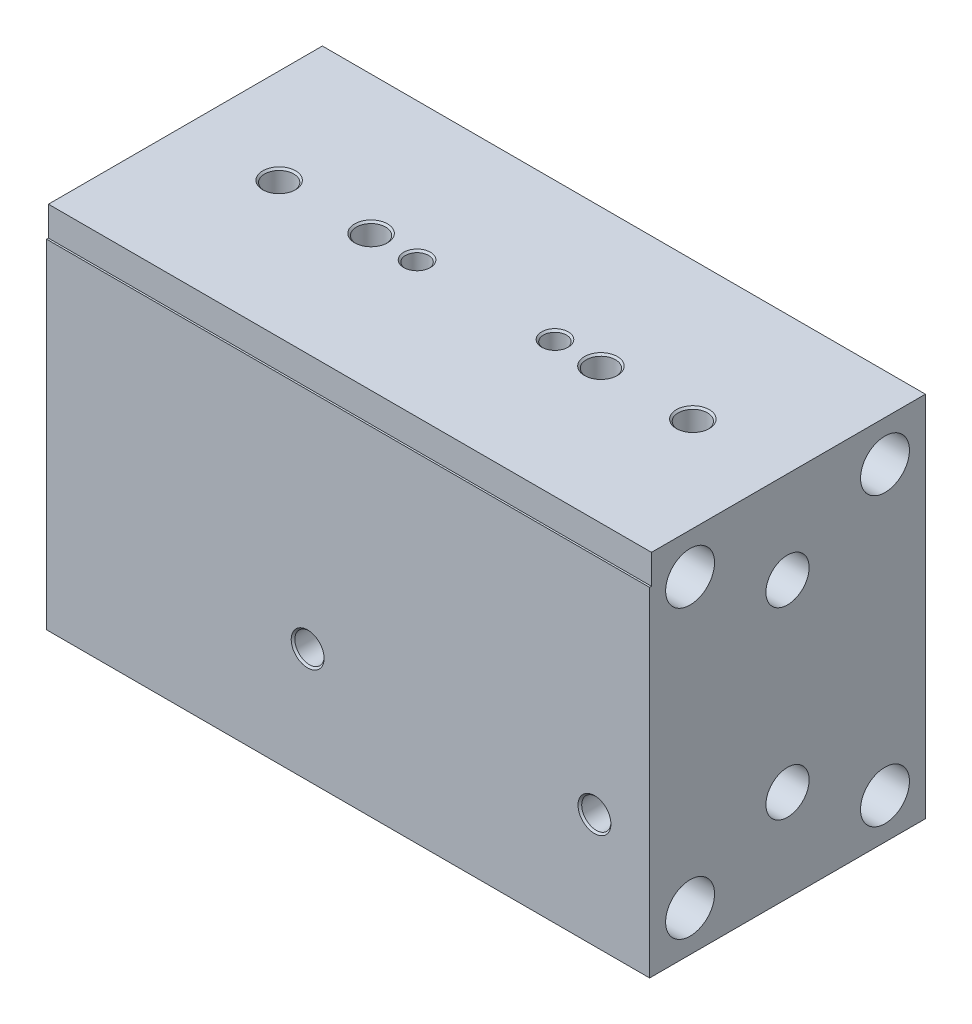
ISO-10303-21;
HEADER;
FILE_DESCRIPTION(('STEP AP214'),'2;1');
FILE_NAME('part.step','',(''),(''),'','','');
FILE_SCHEMA(('AUTOMOTIVE_DESIGN { 1 0 10303 214 1 1 1 1 }'));
ENDSEC;
DATA;
#1=APPLICATION_CONTEXT('core data for automotive mechanical design processes');
#2=APPLICATION_PROTOCOL_DEFINITION('international standard','automotive_design',2000,#1);
#3=PRODUCT_CONTEXT('',#1,'mechanical');
#4=PRODUCT('Part','Part','',(#3));
#5=PRODUCT_RELATED_PRODUCT_CATEGORY('part','',(#4));
#6=PRODUCT_DEFINITION_FORMATION('','',#4);
#7=PRODUCT_DEFINITION_CONTEXT('part definition',#1,'design');
#8=PRODUCT_DEFINITION('design','',#6,#7);
#9=PRODUCT_DEFINITION_SHAPE('','',#8);
#10=(LENGTH_UNIT() NAMED_UNIT(*) SI_UNIT(.MILLI.,.METRE.));
#11=(NAMED_UNIT(*) PLANE_ANGLE_UNIT() SI_UNIT($,.RADIAN.));
#12=(NAMED_UNIT(*) SI_UNIT($,.STERADIAN.) SOLID_ANGLE_UNIT());
#13=UNCERTAINTY_MEASURE_WITH_UNIT(LENGTH_MEASURE(1.E-05),#10,'distance_accuracy_value','');
#14=(GEOMETRIC_REPRESENTATION_CONTEXT(3) GLOBAL_UNCERTAINTY_ASSIGNED_CONTEXT((#13)) GLOBAL_UNIT_ASSIGNED_CONTEXT((#10,
#11,#12)) REPRESENTATION_CONTEXT('',''));
#15=CARTESIAN_POINT('',(0.,0.,0.));
#16=DIRECTION('',(0.,0.,1.));
#17=DIRECTION('',(1.,0.,0.));
#18=AXIS2_PLACEMENT_3D('',#15,#16,#17);
#19=CARTESIAN_POINT('',(28.575,15.0876,0.));
#20=DIRECTION('',(0.,1.,0.));
#21=DIRECTION('',(0.,0.,1.));
#22=AXIS2_PLACEMENT_3D('',#19,#20,#21);
#23=CONICAL_SURFACE('',#22,2.0193,1.02974425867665);
#24=CARTESIAN_POINT('',(28.575,15.0876,0.));
#25=DIRECTION('',(0.,1.,0.));
#26=DIRECTION('',(0.,0.,1.));
#27=AXIS2_PLACEMENT_3D('',#24,#25,#26);
#28=CIRCLE('',#27,2.0193);
#29=CARTESIAN_POINT('',(27.6417444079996,15.0876,1.7907));
#30=VERTEX_POINT('',#29);
#31=CARTESIAN_POINT('',(29.5082555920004,15.0876,1.7907));
#32=VERTEX_POINT('',#31);
#33=EDGE_CURVE('E203',#30,#32,#28,.T.);
#34=ORIENTED_EDGE('',*,*,#33,.T.);
#35=CARTESIAN_POINT('',(31.0089887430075,15.4773427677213,1.09252340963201));
#36=CARTESIAN_POINT('',(30.9421118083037,15.454791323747,1.14974932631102));
#37=CARTESIAN_POINT('',(30.8723000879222,15.4317772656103,1.2031629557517));
#38=CARTESIAN_POINT('',(30.7280206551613,15.3856426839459,1.30293398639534));
#39=CARTESIAN_POINT('',(30.6535618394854,15.3625224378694,1.34930432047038));
#40=CARTESIAN_POINT('',(30.5009307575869,15.3169003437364,1.43577307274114));
#41=CARTESIAN_POINT('',(30.4227577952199,15.2943986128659,1.47587030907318));
#42=CARTESIAN_POINT('',(30.2632948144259,15.2506563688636,1.55024440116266));
#43=CARTESIAN_POINT('',(30.1820028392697,15.2294166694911,1.58451752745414));
#44=CARTESIAN_POINT('',(30.0070832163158,15.186453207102,1.65122500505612));
#45=CARTESIAN_POINT('',(29.9131318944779,15.164968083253,1.6829651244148));
#46=CARTESIAN_POINT('',(29.7225412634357,15.1252588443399,1.73970073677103));
#47=CARTESIAN_POINT('',(29.6259019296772,15.1070347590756,1.76469616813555));
#48=CARTESIAN_POINT('',(29.4304277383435,15.074691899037,1.80798506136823));
#49=CARTESIAN_POINT('',(29.3315924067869,15.0605740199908,1.82627706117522));
#50=CARTESIAN_POINT('',(29.1323307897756,15.0372087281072,1.85608607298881));
#51=CARTESIAN_POINT('',(29.0319045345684,15.0279612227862,1.86760321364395));
#52=CARTESIAN_POINT('',(28.8256682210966,15.0146105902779,1.88412817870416));
#53=CARTESIAN_POINT('',(28.7198167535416,15.0107535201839,1.88882502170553));
#54=CARTESIAN_POINT('',(28.5079943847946,15.0092427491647,1.89067170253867));
#55=CARTESIAN_POINT('',(28.4020234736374,15.0115896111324,1.88782085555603));
#56=CARTESIAN_POINT('',(28.1910626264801,15.0223080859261,1.8746189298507));
#57=CARTESIAN_POINT('',(28.086071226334,15.0306684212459,1.86428189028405));
#58=CARTESIAN_POINT('',(27.8777001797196,15.0528335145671,1.83622761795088));
#59=CARTESIAN_POINT('',(27.7743201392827,15.0666369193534,1.81851221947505));
#60=CARTESIAN_POINT('',(27.5657398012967,15.0995035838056,1.7749355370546));
#61=CARTESIAN_POINT('',(27.4606313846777,15.1187546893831,1.74877751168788));
#62=CARTESIAN_POINT('',(27.2532337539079,15.1612371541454,1.68846565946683));
#63=CARTESIAN_POINT('',(27.1509531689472,15.1844794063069,1.65428985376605));
#64=CARTESIAN_POINT('',(26.9578477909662,15.2319094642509,1.58064687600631));
#65=CARTESIAN_POINT('',(26.8667433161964,15.2558909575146,1.54177972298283));
#66=CARTESIAN_POINT('',(26.6883985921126,15.3053904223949,1.45657574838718));
#67=CARTESIAN_POINT('',(26.6011618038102,15.3309097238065,1.41023240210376));
#68=CARTESIAN_POINT('',(26.4321404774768,15.3823599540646,1.30971729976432));
#69=CARTESIAN_POINT('',(26.3503276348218,15.4082876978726,1.25559178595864));
#70=CARTESIAN_POINT('',(26.1932480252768,15.4595789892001,1.13844140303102));
#71=CARTESIAN_POINT('',(26.1179687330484,15.4849435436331,1.07543419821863));
#72=CARTESIAN_POINT('',(26.0198761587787,15.5187339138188,0.981199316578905));
#73=CARTESIAN_POINT('',(25.9932347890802,15.5279956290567,0.95421937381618));
#74=CARTESIAN_POINT('',(25.9414601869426,15.5461355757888,0.898669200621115));
#75=CARTESIAN_POINT('',(25.9163286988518,15.5550133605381,0.870097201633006));
#76=CARTESIAN_POINT('',(25.8920671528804,15.5636429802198,0.840707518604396));
#77=B_SPLINE_CURVE_WITH_KNOTS('',3,(#35,#36,#37,#38,#39,#40,#41,#42,#43,#44,#45,#46,#47,#48,#49,
#50,#51,#52,#53,#54,#55,#56,#57,#58,#59,#60,#61,#62,#63,#64,#65,#66,#67,#68,#69,#70,#71,#72,#73,
#74,#75,#76),.UNSPECIFIED.,.F.,.F.,(4,2,2,2,2,2,2,2,2,2,2,2,2,2,2,2,2,2,2,2,4),(0.,
0.272275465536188,0.544044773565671,0.815865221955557,1.08785907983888,1.3919492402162,
1.69604217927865,2.0002014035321,2.30435485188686,2.62198296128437,2.9396398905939,
3.2567026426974,3.57368661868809,3.90331466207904,4.2338570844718,4.53926328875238,
4.84493748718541,5.14886515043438,5.45219666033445,5.56923672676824,5.68640950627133),.UNSPECIFIED.);
#78=EDGE_CURVE('E56',#32,#30,#77,.T.);
#79=ORIENTED_EDGE('',*,*,#78,.T.);
#80=EDGE_LOOP('',(#34,#79));
#81=FACE_BOUND('',#80,.T.);
#82=ADVANCED_FACE('F37',(#81),#23,.F.);
#83=CARTESIAN_POINT('',(-28.575,15.0876,0.));
#84=DIRECTION('',(0.,1.,0.));
#85=DIRECTION('',(0.,0.,1.));
#86=AXIS2_PLACEMENT_3D('',#83,#84,#85);
#87=CONICAL_SURFACE('',#86,2.0193,1.02974425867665);
#88=CARTESIAN_POINT('',(-28.575,15.0876,0.));
#89=DIRECTION('',(0.,1.,0.));
#90=DIRECTION('',(0.,0.,1.));
#91=AXIS2_PLACEMENT_3D('',#88,#89,#90);
#92=CIRCLE('',#91,2.0193);
#93=CARTESIAN_POINT('',(-29.5082555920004,15.0876,1.7907));
#94=VERTEX_POINT('',#93);
#95=CARTESIAN_POINT('',(-27.6417444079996,15.0876,1.7907));
#96=VERTEX_POINT('',#95);
#97=EDGE_CURVE('E199',#94,#96,#92,.T.);
#98=ORIENTED_EDGE('',*,*,#97,.T.);
#99=CARTESIAN_POINT('',(-26.1410112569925,15.4773427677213,1.09252340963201));
#100=CARTESIAN_POINT('',(-26.2078881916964,15.4547913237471,1.14974932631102));
#101=CARTESIAN_POINT('',(-26.2776999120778,15.4317772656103,1.2031629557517));
#102=CARTESIAN_POINT('',(-26.4219793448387,15.3856426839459,1.30293398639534));
#103=CARTESIAN_POINT('',(-26.4964381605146,15.3625224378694,1.34930432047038));
#104=CARTESIAN_POINT('',(-26.6490692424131,15.3169003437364,1.43577307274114));
#105=CARTESIAN_POINT('',(-26.7272422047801,15.2943986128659,1.47587030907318));
#106=CARTESIAN_POINT('',(-26.8867051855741,15.2506563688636,1.55024440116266));
#107=CARTESIAN_POINT('',(-26.9679971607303,15.2294166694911,1.58451752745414));
#108=CARTESIAN_POINT('',(-27.1429167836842,15.186453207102,1.65122500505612));
#109=CARTESIAN_POINT('',(-27.2368681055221,15.164968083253,1.6829651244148));
#110=CARTESIAN_POINT('',(-27.4274587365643,15.1252588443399,1.73970073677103));
#111=CARTESIAN_POINT('',(-27.5240980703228,15.1070347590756,1.76469616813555));
#112=CARTESIAN_POINT('',(-27.7195722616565,15.074691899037,1.80798506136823));
#113=CARTESIAN_POINT('',(-27.8184075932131,15.0605740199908,1.82627706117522));
#114=CARTESIAN_POINT('',(-28.0176692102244,15.0372087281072,1.85608607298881));
#115=CARTESIAN_POINT('',(-28.1180954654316,15.0279612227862,1.86760321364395));
#116=CARTESIAN_POINT('',(-28.3243317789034,15.0146105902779,1.88412817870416));
#117=CARTESIAN_POINT('',(-28.4301832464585,15.0107535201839,1.88882502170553));
#118=CARTESIAN_POINT('',(-28.6420056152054,15.0092427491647,1.89067170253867));
#119=CARTESIAN_POINT('',(-28.7479765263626,15.0115896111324,1.88782085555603));
#120=CARTESIAN_POINT('',(-28.9589373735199,15.0223080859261,1.8746189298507));
#121=CARTESIAN_POINT('',(-29.063928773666,15.0306684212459,1.86428189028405));
#122=CARTESIAN_POINT('',(-29.2722998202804,15.0528335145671,1.83622761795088));
#123=CARTESIAN_POINT('',(-29.3756798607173,15.0666369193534,1.81851221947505));
#124=CARTESIAN_POINT('',(-29.5842601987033,15.0995035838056,1.7749355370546));
#125=CARTESIAN_POINT('',(-29.6893686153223,15.1187546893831,1.74877751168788));
#126=CARTESIAN_POINT('',(-29.8967662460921,15.1612371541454,1.68846565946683));
#127=CARTESIAN_POINT('',(-29.9990468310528,15.1844794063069,1.65428985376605));
#128=CARTESIAN_POINT('',(-30.1921522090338,15.2319094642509,1.58064687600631));
#129=CARTESIAN_POINT('',(-30.2832566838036,15.2558909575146,1.54177972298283));
#130=CARTESIAN_POINT('',(-30.4616014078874,15.3053904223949,1.45657574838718));
#131=CARTESIAN_POINT('',(-30.5488381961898,15.3309097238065,1.41023240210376));
#132=CARTESIAN_POINT('',(-30.7178595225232,15.3823599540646,1.30971729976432));
#133=CARTESIAN_POINT('',(-30.7996723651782,15.4082876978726,1.25559178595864));
#134=CARTESIAN_POINT('',(-30.9567519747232,15.4595789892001,1.13844140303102));
#135=CARTESIAN_POINT('',(-31.0320312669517,15.4849435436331,1.07543419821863));
#136=CARTESIAN_POINT('',(-31.1301238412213,15.5187339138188,0.981199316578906));
#137=CARTESIAN_POINT('',(-31.1567652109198,15.5279956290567,0.954219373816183));
#138=CARTESIAN_POINT('',(-31.2085398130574,15.5461355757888,0.898669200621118));
#139=CARTESIAN_POINT('',(-31.2336713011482,15.5550133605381,0.87009720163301));
#140=CARTESIAN_POINT('',(-31.2579328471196,15.5636429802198,0.840707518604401));
#141=B_SPLINE_CURVE_WITH_KNOTS('',3,(#99,#100,#101,#102,#103,#104,#105,#106,#107,#108,#109,#110,
#111,#112,#113,#114,#115,#116,#117,#118,#119,#120,#121,#122,#123,#124,#125,#126,#127,#128,#129,
#130,#131,#132,#133,#134,#135,#136,#137,#138,#139,#140),.UNSPECIFIED.,.F.,.F.,(4,2,2,2,2,2,2,2,
2,2,2,2,2,2,2,2,2,2,2,2,4),(0.,0.272275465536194,0.544044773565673,0.81586522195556,
1.08785907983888,1.39194924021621,1.69604217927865,2.0002014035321,2.30435485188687,
2.62198296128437,2.93963989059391,3.2567026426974,3.5736866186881,3.90331466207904,
4.23385708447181,4.53926328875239,4.84493748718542,5.14886515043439,5.45219666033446,
5.56923672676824,5.68640950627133),.UNSPECIFIED.);
#142=EDGE_CURVE('E64',#96,#94,#141,.T.);
#143=ORIENTED_EDGE('',*,*,#142,.T.);
#144=EDGE_LOOP('',(#98,#143));
#145=FACE_BOUND('',#144,.T.);
#146=ADVANCED_FACE('F352',(#145),#87,.F.);
#147=CARTESIAN_POINT('',(15.875,15.0876,0.));
#148=DIRECTION('',(0.,1.,0.));
#149=DIRECTION('',(0.,0.,1.));
#150=AXIS2_PLACEMENT_3D('',#147,#148,#149);
#151=CONICAL_SURFACE('',#150,2.0193,1.02974425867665);
#152=CARTESIAN_POINT('',(15.875,15.0876,0.));
#153=DIRECTION('',(0.,1.,0.));
#154=DIRECTION('',(0.,0.,1.));
#155=AXIS2_PLACEMENT_3D('',#152,#153,#154);
#156=CIRCLE('',#155,2.0193);
#157=CARTESIAN_POINT('',(14.9417444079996,15.0876,1.7907));
#158=VERTEX_POINT('',#157);
#159=CARTESIAN_POINT('',(16.8082555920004,15.0876,1.7907));
#160=VERTEX_POINT('',#159);
#161=EDGE_CURVE('E189',#158,#160,#156,.T.);
#162=ORIENTED_EDGE('',*,*,#161,.T.);
#163=CARTESIAN_POINT('',(18.3089887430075,15.4773427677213,1.09252340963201));
#164=CARTESIAN_POINT('',(18.2421118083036,15.454791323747,1.14974932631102));
#165=CARTESIAN_POINT('',(18.1723000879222,15.4317772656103,1.2031629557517));
#166=CARTESIAN_POINT('',(18.0280206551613,15.3856426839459,1.30293398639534));
#167=CARTESIAN_POINT('',(17.9535618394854,15.3625224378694,1.34930432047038));
#168=CARTESIAN_POINT('',(17.8009307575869,15.3169003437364,1.43577307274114));
#169=CARTESIAN_POINT('',(17.7227577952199,15.2943986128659,1.47587030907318));
#170=CARTESIAN_POINT('',(17.5632948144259,15.2506563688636,1.55024440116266));
#171=CARTESIAN_POINT('',(17.4820028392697,15.2294166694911,1.58451752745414));
#172=CARTESIAN_POINT('',(17.3070832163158,15.186453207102,1.65122500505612));
#173=CARTESIAN_POINT('',(17.2131318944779,15.164968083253,1.6829651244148));
#174=CARTESIAN_POINT('',(17.0225412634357,15.1252588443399,1.73970073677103));
#175=CARTESIAN_POINT('',(16.9259019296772,15.1070347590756,1.76469616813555));
#176=CARTESIAN_POINT('',(16.7304277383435,15.074691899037,1.80798506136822));
#177=CARTESIAN_POINT('',(16.6315924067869,15.0605740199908,1.82627706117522));
#178=CARTESIAN_POINT('',(16.4323307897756,15.0372087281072,1.85608607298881));
#179=CARTESIAN_POINT('',(16.3319045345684,15.0279612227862,1.86760321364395));
#180=CARTESIAN_POINT('',(16.1256682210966,15.0146105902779,1.88412817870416));
#181=CARTESIAN_POINT('',(16.0198167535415,15.0107535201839,1.88882502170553));
#182=CARTESIAN_POINT('',(15.8079943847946,15.0092427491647,1.89067170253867));
#183=CARTESIAN_POINT('',(15.7020234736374,15.0115896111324,1.88782085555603));
#184=CARTESIAN_POINT('',(15.4910626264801,15.0223080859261,1.8746189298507));
#185=CARTESIAN_POINT('',(15.386071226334,15.0306684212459,1.86428189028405));
#186=CARTESIAN_POINT('',(15.1777001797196,15.0528335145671,1.83622761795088));
#187=CARTESIAN_POINT('',(15.0743201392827,15.0666369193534,1.81851221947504));
#188=CARTESIAN_POINT('',(14.8657398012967,15.0995035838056,1.7749355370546));
#189=CARTESIAN_POINT('',(14.7606313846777,15.1187546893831,1.74877751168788));
#190=CARTESIAN_POINT('',(14.5532337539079,15.1612371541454,1.68846565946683));
#191=CARTESIAN_POINT('',(14.4509531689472,15.1844794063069,1.65428985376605));
#192=CARTESIAN_POINT('',(14.2578477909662,15.2319094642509,1.58064687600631));
#193=CARTESIAN_POINT('',(14.1667433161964,15.2558909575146,1.54177972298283));
#194=CARTESIAN_POINT('',(13.9883985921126,15.3053904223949,1.45657574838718));
#195=CARTESIAN_POINT('',(13.9011618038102,15.3309097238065,1.41023240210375));
#196=CARTESIAN_POINT('',(13.7321404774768,15.3823599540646,1.30971729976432));
#197=CARTESIAN_POINT('',(13.6503276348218,15.4082876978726,1.25559178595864));
#198=CARTESIAN_POINT('',(13.4932480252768,15.4595789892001,1.13844140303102));
#199=CARTESIAN_POINT('',(13.4179687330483,15.4849435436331,1.07543419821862));
#200=CARTESIAN_POINT('',(13.3198761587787,15.5187339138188,0.981199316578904));
#201=CARTESIAN_POINT('',(13.2932347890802,15.5279956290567,0.95421937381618));
#202=CARTESIAN_POINT('',(13.2414601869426,15.5461355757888,0.898669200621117));
#203=CARTESIAN_POINT('',(13.2163286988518,15.5550133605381,0.870097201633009));
#204=CARTESIAN_POINT('',(13.1920671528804,15.5636429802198,0.8407075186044));
#205=B_SPLINE_CURVE_WITH_KNOTS('',3,(#163,#164,#165,#166,#167,#168,#169,#170,#171,#172,#173,
#174,#175,#176,#177,#178,#179,#180,#181,#182,#183,#184,#185,#186,#187,#188,#189,#190,#191,#192,
#193,#194,#195,#196,#197,#198,#199,#200,#201,#202,#203,#204),.UNSPECIFIED.,.F.,.F.,(4,2,2,2,2,2,
2,2,2,2,2,2,2,2,2,2,2,2,2,2,4),(0.,0.27227546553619,0.544044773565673,0.815865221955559,
1.08785907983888,1.39194924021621,1.69604217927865,2.0002014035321,2.30435485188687,
2.62198296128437,2.9396398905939,3.2567026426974,3.5736866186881,3.90331466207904,
4.2338570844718,4.53926328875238,4.84493748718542,5.14886515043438,5.45219666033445,
5.56923672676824,5.68640950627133),.UNSPECIFIED.);
#206=EDGE_CURVE('E414',#160,#158,#205,.T.);
#207=ORIENTED_EDGE('',*,*,#206,.T.);
#208=EDGE_LOOP('',(#162,#207));
#209=FACE_BOUND('',#208,.T.);
#210=ADVANCED_FACE('F359',(#209),#151,.F.);
#211=CARTESIAN_POINT('',(-15.875,15.0876,0.));
#212=DIRECTION('',(0.,1.,0.));
#213=DIRECTION('',(0.,0.,1.));
#214=AXIS2_PLACEMENT_3D('',#211,#212,#213);
#215=CONICAL_SURFACE('',#214,2.0193,1.02974425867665);
#216=CARTESIAN_POINT('',(-15.875,15.0876,0.));
#217=DIRECTION('',(0.,1.,0.));
#218=DIRECTION('',(0.,0.,1.));
#219=AXIS2_PLACEMENT_3D('',#216,#217,#218);
#220=CIRCLE('',#219,2.0193);
#221=CARTESIAN_POINT('',(-16.8082555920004,15.0876,1.7907));
#222=VERTEX_POINT('',#221);
#223=CARTESIAN_POINT('',(-14.9417444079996,15.0876,1.7907));
#224=VERTEX_POINT('',#223);
#225=EDGE_CURVE('E190',#222,#224,#220,.T.);
#226=ORIENTED_EDGE('',*,*,#225,.T.);
#227=CARTESIAN_POINT('',(-13.4410112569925,15.4773427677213,1.09252340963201));
#228=CARTESIAN_POINT('',(-13.5078881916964,15.4547913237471,1.14974932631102));
#229=CARTESIAN_POINT('',(-13.5776999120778,15.4317772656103,1.2031629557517));
#230=CARTESIAN_POINT('',(-13.7219793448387,15.3856426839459,1.30293398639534));
#231=CARTESIAN_POINT('',(-13.7964381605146,15.3625224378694,1.34930432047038));
#232=CARTESIAN_POINT('',(-13.9490692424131,15.3169003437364,1.43577307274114));
#233=CARTESIAN_POINT('',(-14.0272422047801,15.2943986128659,1.47587030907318));
#234=CARTESIAN_POINT('',(-14.1867051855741,15.2506563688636,1.55024440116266));
#235=CARTESIAN_POINT('',(-14.2679971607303,15.2294166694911,1.58451752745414));
#236=CARTESIAN_POINT('',(-14.4429167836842,15.186453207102,1.65122500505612));
#237=CARTESIAN_POINT('',(-14.5368681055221,15.164968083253,1.6829651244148));
#238=CARTESIAN_POINT('',(-14.7274587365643,15.1252588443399,1.73970073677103));
#239=CARTESIAN_POINT('',(-14.8240980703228,15.1070347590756,1.76469616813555));
#240=CARTESIAN_POINT('',(-15.0195722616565,15.074691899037,1.80798506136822));
#241=CARTESIAN_POINT('',(-15.1184075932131,15.0605740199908,1.82627706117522));
#242=CARTESIAN_POINT('',(-15.3176692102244,15.0372087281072,1.85608607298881));
#243=CARTESIAN_POINT('',(-15.4180954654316,15.0279612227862,1.86760321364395));
#244=CARTESIAN_POINT('',(-15.6243317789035,15.0146105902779,1.88412817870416));
#245=CARTESIAN_POINT('',(-15.7301832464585,15.0107535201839,1.88882502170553));
#246=CARTESIAN_POINT('',(-15.9420056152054,15.0092427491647,1.89067170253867));
#247=CARTESIAN_POINT('',(-16.0479765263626,15.0115896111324,1.88782085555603));
#248=CARTESIAN_POINT('',(-16.2589373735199,15.0223080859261,1.8746189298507));
#249=CARTESIAN_POINT('',(-16.363928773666,15.0306684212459,1.86428189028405));
#250=CARTESIAN_POINT('',(-16.5722998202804,15.0528335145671,1.83622761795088));
#251=CARTESIAN_POINT('',(-16.6756798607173,15.0666369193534,1.81851221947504));
#252=CARTESIAN_POINT('',(-16.8842601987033,15.0995035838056,1.7749355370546));
#253=CARTESIAN_POINT('',(-16.9893686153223,15.1187546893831,1.74877751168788));
#254=CARTESIAN_POINT('',(-17.1967662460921,15.1612371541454,1.68846565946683));
#255=CARTESIAN_POINT('',(-17.2990468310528,15.1844794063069,1.65428985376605));
#256=CARTESIAN_POINT('',(-17.4921522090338,15.2319094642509,1.58064687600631));
#257=CARTESIAN_POINT('',(-17.5832566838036,15.2558909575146,1.54177972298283));
#258=CARTESIAN_POINT('',(-17.7616014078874,15.3053904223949,1.45657574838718));
#259=CARTESIAN_POINT('',(-17.8488381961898,15.3309097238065,1.41023240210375));
#260=CARTESIAN_POINT('',(-18.0178595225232,15.3823599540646,1.30971729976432));
#261=CARTESIAN_POINT('',(-18.0996723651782,15.4082876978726,1.25559178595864));
#262=CARTESIAN_POINT('',(-18.2567519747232,15.4595789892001,1.13844140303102));
#263=CARTESIAN_POINT('',(-18.3320312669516,15.4849435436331,1.07543419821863));
#264=CARTESIAN_POINT('',(-18.4301238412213,15.5187339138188,0.981199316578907));
#265=CARTESIAN_POINT('',(-18.4567652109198,15.5279956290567,0.954219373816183));
#266=CARTESIAN_POINT('',(-18.5085398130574,15.5461355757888,0.898669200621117));
#267=CARTESIAN_POINT('',(-18.5336713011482,15.5550133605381,0.870097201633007));
#268=CARTESIAN_POINT('',(-18.5579328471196,15.5636429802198,0.840707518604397));
#269=B_SPLINE_CURVE_WITH_KNOTS('',3,(#227,#228,#229,#230,#231,#232,#233,#234,#235,#236,#237,
#238,#239,#240,#241,#242,#243,#244,#245,#246,#247,#248,#249,#250,#251,#252,#253,#254,#255,#256,
#257,#258,#259,#260,#261,#262,#263,#264,#265,#266,#267,#268),.UNSPECIFIED.,.F.,.F.,(4,2,2,2,2,2,
2,2,2,2,2,2,2,2,2,2,2,2,2,2,4),(0.,0.272275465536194,0.544044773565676,0.815865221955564,
1.08785907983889,1.39194924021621,1.69604217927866,2.00020140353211,2.30435485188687,
2.62198296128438,2.93963989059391,3.2567026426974,3.5736866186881,3.90331466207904,
4.23385708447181,4.53926328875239,4.84493748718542,5.14886515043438,5.45219666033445,
5.56923672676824,5.68640950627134),.UNSPECIFIED.);
#270=EDGE_CURVE('E176',#224,#222,#269,.T.);
#271=ORIENTED_EDGE('',*,*,#270,.T.);
#272=EDGE_LOOP('',(#226,#271));
#273=FACE_BOUND('',#272,.T.);
#274=ADVANCED_FACE('F551',(#273),#215,.F.);
#275=CARTESIAN_POINT('',(-41.656,25.4,19.05));
#276=DIRECTION('',(1.,0.,0.));
#277=DIRECTION('',(0.,1.,0.));
#278=AXIS2_PLACEMENT_3D('',#275,#276,#277);
#279=PLANE('',#278);
#280=CARTESIAN_POINT('',(-41.656,-12.7,0.));
#281=DIRECTION('',(1.,0.,0.));
#282=DIRECTION('',(0.,0.,-1.));
#283=AXIS2_PLACEMENT_3D('',#280,#281,#282);
#284=CIRCLE('',#283,2.9845);
#285=CARTESIAN_POINT('',(-41.656,-12.7,-2.9845));
#286=VERTEX_POINT('',#285);
#287=EDGE_CURVE('E1064',#286,#286,#284,.T.);
#288=ORIENTED_EDGE('',*,*,#287,.T.);
#289=EDGE_LOOP('',(#288));
#290=FACE_BOUND('',#289,.T.);
#291=CARTESIAN_POINT('',(-41.656,12.7,0.));
#292=DIRECTION('',(1.,0.,0.));
#293=DIRECTION('',(0.,0.,-1.));
#294=AXIS2_PLACEMENT_3D('',#291,#292,#293);
#295=CIRCLE('',#294,2.9845);
#296=CARTESIAN_POINT('',(-41.656,12.7,-2.9845));
#297=VERTEX_POINT('',#296);
#298=EDGE_CURVE('E186',#297,#297,#295,.T.);
#299=ORIENTED_EDGE('',*,*,#298,.T.);
#300=EDGE_LOOP('',(#299));
#301=FACE_BOUND('',#300,.T.);
#302=CARTESIAN_POINT('',(-41.656,-19.812,-13.462));
#303=DIRECTION('',(1.,0.,0.));
#304=DIRECTION('',(0.,0.,-1.));
#305=AXIS2_PLACEMENT_3D('',#302,#303,#304);
#306=CIRCLE('',#305,3.3782);
#307=CARTESIAN_POINT('',(-41.656,-19.812,-16.8402));
#308=VERTEX_POINT('',#307);
#309=EDGE_CURVE('E390',#308,#308,#306,.T.);
#310=ORIENTED_EDGE('',*,*,#309,.T.);
#311=EDGE_LOOP('',(#310));
#312=FACE_BOUND('',#311,.T.);
#313=CARTESIAN_POINT('',(-41.656,-19.812,13.462));
#314=DIRECTION('',(1.,0.,0.));
#315=DIRECTION('',(0.,0.,-1.));
#316=AXIS2_PLACEMENT_3D('',#313,#314,#315);
#317=CIRCLE('',#316,3.3782);
#318=CARTESIAN_POINT('',(-41.656,-19.812,10.0838));
#319=VERTEX_POINT('',#318);
#320=EDGE_CURVE('E481',#319,#319,#317,.T.);
#321=ORIENTED_EDGE('',*,*,#320,.T.);
#322=EDGE_LOOP('',(#321));
#323=FACE_BOUND('',#322,.T.);
#324=CARTESIAN_POINT('',(-41.656,19.812,-13.462));
#325=DIRECTION('',(1.,0.,0.));
#326=DIRECTION('',(0.,0.,-1.));
#327=AXIS2_PLACEMENT_3D('',#324,#325,#326);
#328=CIRCLE('',#327,3.3782);
#329=CARTESIAN_POINT('',(-41.656,19.812,-16.8402));
#330=VERTEX_POINT('',#329);
#331=EDGE_CURVE('E487',#330,#330,#328,.T.);
#332=ORIENTED_EDGE('',*,*,#331,.T.);
#333=EDGE_LOOP('',(#332));
#334=FACE_BOUND('',#333,.T.);
#335=CARTESIAN_POINT('',(-41.656,19.812,13.462));
#336=DIRECTION('',(1.,0.,0.));
#337=DIRECTION('',(0.,0.,-1.));
#338=AXIS2_PLACEMENT_3D('',#335,#336,#337);
#339=CIRCLE('',#338,3.3782);
#340=CARTESIAN_POINT('',(-41.656,19.812,10.0838));
#341=VERTEX_POINT('',#340);
#342=EDGE_CURVE('E493',#341,#341,#339,.T.);
#343=ORIENTED_EDGE('',*,*,#342,.T.);
#344=EDGE_LOOP('',(#343));
#345=FACE_BOUND('',#344,.T.);
#346=DIRECTION('',(0.,0.,-1.));
#347=VECTOR('',#346,1.);
#348=CARTESIAN_POINT('',(-41.656,21.336,19.05));
#349=LINE('',#348,#347);
#350=CARTESIAN_POINT('',(-41.656,21.336,19.05));
#351=VERTEX_POINT('',#350);
#352=CARTESIAN_POINT('',(-41.656,21.336,18.796));
#353=VERTEX_POINT('',#352);
#354=EDGE_CURVE('E207',#351,#353,#349,.T.);
#355=ORIENTED_EDGE('',*,*,#354,.T.);
#356=DIRECTION('',(0.,1.,0.));
#357=VECTOR('',#356,1.);
#358=CARTESIAN_POINT('',(-41.656,21.336,18.796));
#359=LINE('',#358,#357);
#360=CARTESIAN_POINT('',(-41.656,25.4,18.796));
#361=VERTEX_POINT('',#360);
#362=EDGE_CURVE('E210',#353,#361,#359,.T.);
#363=ORIENTED_EDGE('',*,*,#362,.T.);
#364=DIRECTION('',(0.,0.,-1.));
#365=VECTOR('',#364,1.);
#366=CARTESIAN_POINT('',(-41.656,25.4,19.05));
#367=LINE('',#366,#365);
#368=CARTESIAN_POINT('',(-41.656,25.4,-19.05));
#369=VERTEX_POINT('',#368);
#370=EDGE_CURVE('E234',#361,#369,#367,.T.);
#371=ORIENTED_EDGE('',*,*,#370,.T.);
#372=DIRECTION('',(0.,-1.,0.));
#373=VECTOR('',#372,1.);
#374=CARTESIAN_POINT('',(-41.656,25.4,-19.05));
#375=LINE('',#374,#373);
#376=CARTESIAN_POINT('',(-41.656,-25.4,-19.05));
#377=VERTEX_POINT('',#376);
#378=EDGE_CURVE('E222',#369,#377,#375,.T.);
#379=ORIENTED_EDGE('',*,*,#378,.T.);
#380=DIRECTION('',(0.,0.,-1.));
#381=VECTOR('',#380,1.);
#382=CARTESIAN_POINT('',(-41.656,-25.4,19.05));
#383=LINE('',#382,#381);
#384=CARTESIAN_POINT('',(-41.656,-25.4,19.05));
#385=VERTEX_POINT('',#384);
#386=EDGE_CURVE('E250',#385,#377,#383,.T.);
#387=ORIENTED_EDGE('',*,*,#386,.F.);
#388=DIRECTION('',(0.,-1.,0.));
#389=VECTOR('',#388,1.);
#390=CARTESIAN_POINT('',(-41.656,25.4,19.05));
#391=LINE('',#390,#389);
#392=EDGE_CURVE('E226',#351,#385,#391,.T.);
#393=ORIENTED_EDGE('',*,*,#392,.F.);
#394=EDGE_LOOP('',(#355,#363,#371,#379,#387,#393));
#395=FACE_BOUND('',#394,.T.);
#396=ADVANCED_FACE('F558',(#290,#301,#312,#323,#334,#345,#395),#279,.F.);
#397=CARTESIAN_POINT('',(-41.656,-25.4,19.05));
#398=DIRECTION('',(0.,1.,0.));
#399=DIRECTION('',(0.,0.,1.));
#400=AXIS2_PLACEMENT_3D('',#397,#398,#399);
#401=PLANE('',#400);
#402=DIRECTION('',(1.,0.,0.));
#403=VECTOR('',#402,1.);
#404=CARTESIAN_POINT('',(-41.656,-25.4,-19.05));
#405=LINE('',#404,#403);
#406=CARTESIAN_POINT('',(41.656,-25.4,-19.05));
#407=VERTEX_POINT('',#406);
#408=EDGE_CURVE('E237',#377,#407,#405,.T.);
#409=ORIENTED_EDGE('',*,*,#408,.T.);
#410=DIRECTION('',(0.,0.,-1.));
#411=VECTOR('',#410,1.);
#412=CARTESIAN_POINT('',(41.656,-25.4,19.05));
#413=LINE('',#412,#411);
#414=CARTESIAN_POINT('',(41.656,-25.4,19.05));
#415=VERTEX_POINT('',#414);
#416=EDGE_CURVE('E247',#415,#407,#413,.T.);
#417=ORIENTED_EDGE('',*,*,#416,.F.);
#418=DIRECTION('',(1.,0.,0.));
#419=VECTOR('',#418,1.);
#420=CARTESIAN_POINT('',(-41.656,-25.4,19.05));
#421=LINE('',#420,#419);
#422=EDGE_CURVE('E228',#385,#415,#421,.T.);
#423=ORIENTED_EDGE('',*,*,#422,.F.);
#424=ORIENTED_EDGE('',*,*,#386,.T.);
#425=EDGE_LOOP('',(#409,#417,#423,#424));
#426=FACE_BOUND('',#425,.T.);
#427=ADVANCED_FACE('F563',(#426),#401,.F.);
#428=CARTESIAN_POINT('',(41.656,-25.4,19.05));
#429=DIRECTION('',(-1.,0.,0.));
#430=DIRECTION('',(0.,0.,1.));
#431=AXIS2_PLACEMENT_3D('',#428,#429,#430);
#432=PLANE('',#431);
#433=CARTESIAN_POINT('',(41.656,-12.7,0.));
#434=DIRECTION('',(1.,0.,0.));
#435=DIRECTION('',(0.,0.,-1.));
#436=AXIS2_PLACEMENT_3D('',#433,#434,#435);
#437=CIRCLE('',#436,2.9845);
#438=CARTESIAN_POINT('',(41.656,-12.7,-2.9845));
#439=VERTEX_POINT('',#438);
#440=EDGE_CURVE('E1067',#439,#439,#437,.T.);
#441=ORIENTED_EDGE('',*,*,#440,.F.);
#442=EDGE_LOOP('',(#441));
#443=FACE_BOUND('',#442,.T.);
#444=CARTESIAN_POINT('',(41.656,12.7,0.));
#445=DIRECTION('',(1.,0.,0.));
#446=DIRECTION('',(0.,0.,-1.));
#447=AXIS2_PLACEMENT_3D('',#444,#445,#446);
#448=CIRCLE('',#447,2.9845);
#449=CARTESIAN_POINT('',(41.656,12.7,-2.9845));
#450=VERTEX_POINT('',#449);
#451=EDGE_CURVE('E1069',#450,#450,#448,.T.);
#452=ORIENTED_EDGE('',*,*,#451,.F.);
#453=EDGE_LOOP('',(#452));
#454=FACE_BOUND('',#453,.T.);
#455=CARTESIAN_POINT('',(41.656,-19.812,-13.462));
#456=DIRECTION('',(1.,0.,0.));
#457=DIRECTION('',(0.,0.,-1.));
#458=AXIS2_PLACEMENT_3D('',#455,#456,#457);
#459=CIRCLE('',#458,3.3782);
#460=CARTESIAN_POINT('',(41.656,-19.812,-16.8402));
#461=VERTEX_POINT('',#460);
#462=EDGE_CURVE('E387',#461,#461,#459,.T.);
#463=ORIENTED_EDGE('',*,*,#462,.F.);
#464=EDGE_LOOP('',(#463));
#465=FACE_BOUND('',#464,.T.);
#466=CARTESIAN_POINT('',(41.656,-19.812,13.462));
#467=DIRECTION('',(1.,0.,0.));
#468=DIRECTION('',(0.,0.,-1.));
#469=AXIS2_PLACEMENT_3D('',#466,#467,#468);
#470=CIRCLE('',#469,3.3782);
#471=CARTESIAN_POINT('',(41.656,-19.812,10.0838));
#472=VERTEX_POINT('',#471);
#473=EDGE_CURVE('E479',#472,#472,#470,.T.);
#474=ORIENTED_EDGE('',*,*,#473,.F.);
#475=EDGE_LOOP('',(#474));
#476=FACE_BOUND('',#475,.T.);
#477=CARTESIAN_POINT('',(41.656,19.812,-13.462));
#478=DIRECTION('',(1.,0.,0.));
#479=DIRECTION('',(0.,0.,-1.));
#480=AXIS2_PLACEMENT_3D('',#477,#478,#479);
#481=CIRCLE('',#480,3.3782);
#482=CARTESIAN_POINT('',(41.656,19.812,-16.8402));
#483=VERTEX_POINT('',#482);
#484=EDGE_CURVE('E484',#483,#483,#481,.T.);
#485=ORIENTED_EDGE('',*,*,#484,.F.);
#486=EDGE_LOOP('',(#485));
#487=FACE_BOUND('',#486,.T.);
#488=CARTESIAN_POINT('',(41.656,19.812,13.462));
#489=DIRECTION('',(1.,0.,0.));
#490=DIRECTION('',(0.,0.,-1.));
#491=AXIS2_PLACEMENT_3D('',#488,#489,#490);
#492=CIRCLE('',#491,3.3782);
#493=CARTESIAN_POINT('',(41.656,19.812,10.0838));
#494=VERTEX_POINT('',#493);
#495=EDGE_CURVE('E490',#494,#494,#492,.T.);
#496=ORIENTED_EDGE('',*,*,#495,.F.);
#497=EDGE_LOOP('',(#496));
#498=FACE_BOUND('',#497,.T.);
#499=DIRECTION('',(0.,0.,-1.));
#500=VECTOR('',#499,1.);
#501=CARTESIAN_POINT('',(41.656,25.4,19.05));
#502=LINE('',#501,#500);
#503=CARTESIAN_POINT('',(41.656,25.4,18.796));
#504=VERTEX_POINT('',#503);
#505=CARTESIAN_POINT('',(41.656,25.4,-19.05));
#506=VERTEX_POINT('',#505);
#507=EDGE_CURVE('E245',#504,#506,#502,.T.);
#508=ORIENTED_EDGE('',*,*,#507,.F.);
#509=DIRECTION('',(0.,1.,0.));
#510=VECTOR('',#509,1.);
#511=CARTESIAN_POINT('',(41.656,21.336,18.796));
#512=LINE('',#511,#510);
#513=CARTESIAN_POINT('',(41.656,21.336,18.796));
#514=VERTEX_POINT('',#513);
#515=EDGE_CURVE('E211',#514,#504,#512,.T.);
#516=ORIENTED_EDGE('',*,*,#515,.F.);
#517=DIRECTION('',(0.,0.,-1.));
#518=VECTOR('',#517,1.);
#519=CARTESIAN_POINT('',(41.656,21.336,19.05));
#520=LINE('',#519,#518);
#521=CARTESIAN_POINT('',(41.656,21.336,19.05));
#522=VERTEX_POINT('',#521);
#523=EDGE_CURVE('E215',#522,#514,#520,.T.);
#524=ORIENTED_EDGE('',*,*,#523,.F.);
#525=DIRECTION('',(0.,1.,0.));
#526=VECTOR('',#525,1.);
#527=CARTESIAN_POINT('',(41.656,-25.4,19.05));
#528=LINE('',#527,#526);
#529=EDGE_CURVE('E231',#415,#522,#528,.T.);
#530=ORIENTED_EDGE('',*,*,#529,.F.);
#531=ORIENTED_EDGE('',*,*,#416,.T.);
#532=DIRECTION('',(0.,1.,0.));
#533=VECTOR('',#532,1.);
#534=CARTESIAN_POINT('',(41.656,-25.4,-19.05));
#535=LINE('',#534,#533);
#536=EDGE_CURVE('E239',#407,#506,#535,.T.);
#537=ORIENTED_EDGE('',*,*,#536,.T.);
#538=EDGE_LOOP('',(#508,#516,#524,#530,#531,#537));
#539=FACE_BOUND('',#538,.T.);
#540=ADVANCED_FACE('F642',(#443,#454,#465,#476,#487,#498,#539),#432,.F.);
#541=CARTESIAN_POINT('',(41.656,25.4,19.05));
#542=DIRECTION('',(0.,-1.,0.));
#543=DIRECTION('',(1.,0.,0.));
#544=AXIS2_PLACEMENT_3D('',#541,#542,#543);
#545=PLANE('',#544);
#546=CARTESIAN_POINT('',(28.575,25.4,0.));
#547=DIRECTION('',(0.,-1.,0.));
#548=DIRECTION('',(1.,0.,0.));
#549=AXIS2_PLACEMENT_3D('',#546,#547,#548);
#550=CIRCLE('',#549,2.27330000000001);
#551=CARTESIAN_POINT('',(30.8483,25.4,0.));
#552=VERTEX_POINT('',#551);
#553=EDGE_CURVE('E295',#552,#552,#550,.T.);
#554=ORIENTED_EDGE('',*,*,#553,.T.);
#555=EDGE_LOOP('',(#554));
#556=FACE_BOUND('',#555,.T.);
#557=CARTESIAN_POINT('',(-28.575,25.4,0.));
#558=DIRECTION('',(0.,-1.,0.));
#559=DIRECTION('',(1.,0.,0.));
#560=AXIS2_PLACEMENT_3D('',#557,#558,#559);
#561=CIRCLE('',#560,2.27330000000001);
#562=CARTESIAN_POINT('',(-26.3017,25.4,0.));
#563=VERTEX_POINT('',#562);
#564=EDGE_CURVE('E292',#563,#563,#561,.T.);
#565=ORIENTED_EDGE('',*,*,#564,.T.);
#566=EDGE_LOOP('',(#565));
#567=FACE_BOUND('',#566,.T.);
#568=CARTESIAN_POINT('',(15.875,25.4,0.));
#569=DIRECTION('',(0.,-1.,0.));
#570=DIRECTION('',(1.,0.,0.));
#571=AXIS2_PLACEMENT_3D('',#568,#569,#570);
#572=CIRCLE('',#571,2.27330000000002);
#573=CARTESIAN_POINT('',(18.1483,25.4,0.));
#574=VERTEX_POINT('',#573);
#575=EDGE_CURVE('E289',#574,#574,#572,.T.);
#576=ORIENTED_EDGE('',*,*,#575,.T.);
#577=EDGE_LOOP('',(#576));
#578=FACE_BOUND('',#577,.T.);
#579=CARTESIAN_POINT('',(9.525,25.4,0.));
#580=DIRECTION('',(0.,-1.,0.));
#581=DIRECTION('',(1.,0.,0.));
#582=AXIS2_PLACEMENT_3D('',#579,#580,#581);
#583=CIRCLE('',#582,1.84150000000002);
#584=CARTESIAN_POINT('',(11.3665,25.4,0.));
#585=VERTEX_POINT('',#584);
#586=EDGE_CURVE('E286',#585,#585,#583,.T.);
#587=ORIENTED_EDGE('',*,*,#586,.T.);
#588=EDGE_LOOP('',(#587));
#589=FACE_BOUND('',#588,.T.);
#590=CARTESIAN_POINT('',(-9.525,25.4,0.));
#591=DIRECTION('',(0.,-1.,0.));
#592=DIRECTION('',(1.,0.,0.));
#593=AXIS2_PLACEMENT_3D('',#590,#591,#592);
#594=CIRCLE('',#593,1.84150000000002);
#595=CARTESIAN_POINT('',(-7.68349999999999,25.4,0.));
#596=VERTEX_POINT('',#595);
#597=EDGE_CURVE('E283',#596,#596,#594,.T.);
#598=ORIENTED_EDGE('',*,*,#597,.T.);
#599=EDGE_LOOP('',(#598));
#600=FACE_BOUND('',#599,.T.);
#601=CARTESIAN_POINT('',(-15.875,25.4,0.));
#602=DIRECTION('',(0.,-1.,0.));
#603=DIRECTION('',(1.,0.,0.));
#604=AXIS2_PLACEMENT_3D('',#601,#602,#603);
#605=CIRCLE('',#604,2.27330000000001);
#606=CARTESIAN_POINT('',(-13.6017,25.4,0.));
#607=VERTEX_POINT('',#606);
#608=EDGE_CURVE('E280',#607,#607,#605,.T.);
#609=ORIENTED_EDGE('',*,*,#608,.T.);
#610=EDGE_LOOP('',(#609));
#611=FACE_BOUND('',#610,.T.);
#612=ORIENTED_EDGE('',*,*,#370,.F.);
#613=DIRECTION('',(1.,0.,0.));
#614=VECTOR('',#613,1.);
#615=CARTESIAN_POINT('',(-41.656,25.4,18.796));
#616=LINE('',#615,#614);
#617=EDGE_CURVE('E219',#361,#504,#616,.T.);
#618=ORIENTED_EDGE('',*,*,#617,.T.);
#619=ORIENTED_EDGE('',*,*,#507,.T.);
#620=DIRECTION('',(-1.,0.,0.));
#621=VECTOR('',#620,1.);
#622=CARTESIAN_POINT('',(41.656,25.4,-19.05));
#623=LINE('',#622,#621);
#624=EDGE_CURVE('E229',#506,#369,#623,.T.);
#625=ORIENTED_EDGE('',*,*,#624,.T.);
#626=EDGE_LOOP('',(#612,#618,#619,#625));
#627=FACE_BOUND('',#626,.T.);
#628=ADVANCED_FACE('F638',(#556,#567,#578,#589,#600,#611,#627),#545,.F.);
#629=CARTESIAN_POINT('',(-41.656,25.4,19.05));
#630=DIRECTION('',(0.,0.,-1.));
#631=DIRECTION('',(-1.,0.,0.));
#632=AXIS2_PLACEMENT_3D('',#629,#630,#631);
#633=PLANE('',#632);
#634=CARTESIAN_POINT('',(-5.588,-9.652,19.05));
#635=DIRECTION('',(0.,0.,-1.));
#636=DIRECTION('',(-1.,0.,0.));
#637=AXIS2_PLACEMENT_3D('',#634,#635,#636);
#638=CIRCLE('',#637,2.27330000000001);
#639=CARTESIAN_POINT('',(-7.86130000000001,-9.652,19.05));
#640=VERTEX_POINT('',#639);
#641=EDGE_CURVE('E319',#640,#640,#638,.T.);
#642=ORIENTED_EDGE('',*,*,#641,.T.);
#643=EDGE_LOOP('',(#642));
#644=FACE_BOUND('',#643,.T.);
#645=CARTESIAN_POINT('',(34.036,-9.652,19.05));
#646=DIRECTION('',(0.,0.,-1.));
#647=DIRECTION('',(-1.,0.,0.));
#648=AXIS2_PLACEMENT_3D('',#645,#646,#647);
#649=CIRCLE('',#648,2.27329999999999);
#650=CARTESIAN_POINT('',(31.7627,-9.652,19.05));
#651=VERTEX_POINT('',#650);
#652=EDGE_CURVE('E316',#651,#651,#649,.T.);
#653=ORIENTED_EDGE('',*,*,#652,.T.);
#654=EDGE_LOOP('',(#653));
#655=FACE_BOUND('',#654,.T.);
#656=ORIENTED_EDGE('',*,*,#529,.T.);
#657=DIRECTION('',(1.,0.,0.));
#658=VECTOR('',#657,1.);
#659=CARTESIAN_POINT('',(-41.656,21.336,19.05));
#660=LINE('',#659,#658);
#661=EDGE_CURVE('E214',#351,#522,#660,.T.);
#662=ORIENTED_EDGE('',*,*,#661,.F.);
#663=ORIENTED_EDGE('',*,*,#392,.T.);
#664=ORIENTED_EDGE('',*,*,#422,.T.);
#665=EDGE_LOOP('',(#656,#662,#663,#664));
#666=FACE_BOUND('',#665,.T.);
#667=ADVANCED_FACE('F641',(#644,#655,#666),#633,.F.);
#668=CARTESIAN_POINT('',(-41.656,25.4,-19.05));
#669=DIRECTION('',(0.,0.,-1.));
#670=DIRECTION('',(-1.,0.,0.));
#671=AXIS2_PLACEMENT_3D('',#668,#669,#670);
#672=PLANE('',#671);
#673=CARTESIAN_POINT('',(-25.4,-7.9375,-19.05));
#674=DIRECTION('',(0.,0.,-1.));
#675=DIRECTION('',(-1.,0.,0.));
#676=AXIS2_PLACEMENT_3D('',#673,#674,#675);
#677=CIRCLE('',#676,1.9812);
#678=CARTESIAN_POINT('',(-27.3812,-7.9375,-19.05));
#679=VERTEX_POINT('',#678);
#680=EDGE_CURVE('E271',#679,#679,#677,.F.);
#681=ORIENTED_EDGE('',*,*,#680,.T.);
#682=EDGE_LOOP('',(#681));
#683=FACE_BOUND('',#682,.T.);
#684=CARTESIAN_POINT('',(25.4,-7.9375,-19.05));
#685=DIRECTION('',(0.,0.,-1.));
#686=DIRECTION('',(-1.,0.,0.));
#687=AXIS2_PLACEMENT_3D('',#684,#685,#686);
#688=CIRCLE('',#687,1.9812);
#689=CARTESIAN_POINT('',(23.4188,-7.9375,-19.05));
#690=VERTEX_POINT('',#689);
#691=EDGE_CURVE('E268',#690,#690,#688,.F.);
#692=ORIENTED_EDGE('',*,*,#691,.T.);
#693=EDGE_LOOP('',(#692));
#694=FACE_BOUND('',#693,.T.);
#695=CARTESIAN_POINT('',(-25.4,7.9375,-19.05));
#696=DIRECTION('',(0.,0.,-1.));
#697=DIRECTION('',(-1.,0.,0.));
#698=AXIS2_PLACEMENT_3D('',#695,#696,#697);
#699=CIRCLE('',#698,1.9812);
#700=CARTESIAN_POINT('',(-27.3812,7.9375,-19.05));
#701=VERTEX_POINT('',#700);
#702=EDGE_CURVE('E265',#701,#701,#699,.F.);
#703=ORIENTED_EDGE('',*,*,#702,.T.);
#704=EDGE_LOOP('',(#703));
#705=FACE_BOUND('',#704,.T.);
#706=CARTESIAN_POINT('',(0.,-7.9375,-19.05));
#707=DIRECTION('',(0.,0.,-1.));
#708=DIRECTION('',(-1.,0.,0.));
#709=AXIS2_PLACEMENT_3D('',#706,#707,#708);
#710=CIRCLE('',#709,1.84150000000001);
#711=CARTESIAN_POINT('',(-1.84150000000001,-7.9375,-19.05));
#712=VERTEX_POINT('',#711);
#713=EDGE_CURVE('E262',#712,#712,#710,.F.);
#714=ORIENTED_EDGE('',*,*,#713,.T.);
#715=EDGE_LOOP('',(#714));
#716=FACE_BOUND('',#715,.T.);
#717=CARTESIAN_POINT('',(0.,7.9375,-19.05));
#718=DIRECTION('',(0.,0.,-1.));
#719=DIRECTION('',(-1.,0.,0.));
#720=AXIS2_PLACEMENT_3D('',#717,#718,#719);
#721=CIRCLE('',#720,1.84150000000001);
#722=CARTESIAN_POINT('',(-1.84150000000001,7.9375,-19.05));
#723=VERTEX_POINT('',#722);
#724=EDGE_CURVE('E259',#723,#723,#721,.F.);
#725=ORIENTED_EDGE('',*,*,#724,.T.);
#726=EDGE_LOOP('',(#725));
#727=FACE_BOUND('',#726,.T.);
#728=CARTESIAN_POINT('',(25.4,7.9375,-19.05));
#729=DIRECTION('',(0.,0.,-1.));
#730=DIRECTION('',(-1.,0.,0.));
#731=AXIS2_PLACEMENT_3D('',#728,#729,#730);
#732=CIRCLE('',#731,1.9812);
#733=CARTESIAN_POINT('',(23.4188,7.9375,-19.05));
#734=VERTEX_POINT('',#733);
#735=EDGE_CURVE('E256',#734,#734,#732,.F.);
#736=ORIENTED_EDGE('',*,*,#735,.T.);
#737=EDGE_LOOP('',(#736));
#738=FACE_BOUND('',#737,.T.);
#739=ORIENTED_EDGE('',*,*,#378,.F.);
#740=ORIENTED_EDGE('',*,*,#624,.F.);
#741=ORIENTED_EDGE('',*,*,#536,.F.);
#742=ORIENTED_EDGE('',*,*,#408,.F.);
#743=EDGE_LOOP('',(#739,#740,#741,#742));
#744=FACE_BOUND('',#743,.T.);
#745=ADVANCED_FACE('F664',(#683,#694,#705,#716,#727,#738,#744),#672,.T.);
#746=CARTESIAN_POINT('',(-41.656,21.336,18.796));
#747=DIRECTION('',(0.,0.,-1.));
#748=DIRECTION('',(-1.,0.,0.));
#749=AXIS2_PLACEMENT_3D('',#746,#747,#748);
#750=PLANE('',#749);
#751=ORIENTED_EDGE('',*,*,#515,.T.);
#752=ORIENTED_EDGE('',*,*,#617,.F.);
#753=ORIENTED_EDGE('',*,*,#362,.F.);
#754=DIRECTION('',(1.,0.,0.));
#755=VECTOR('',#754,1.);
#756=CARTESIAN_POINT('',(-41.656,21.336,18.796));
#757=LINE('',#756,#755);
#758=EDGE_CURVE('E223',#353,#514,#757,.T.);
#759=ORIENTED_EDGE('',*,*,#758,.T.);
#760=EDGE_LOOP('',(#751,#752,#753,#759));
#761=FACE_BOUND('',#760,.T.);
#762=ADVANCED_FACE('F375',(#761),#750,.F.);
#763=CARTESIAN_POINT('',(-41.656,21.336,19.05));
#764=DIRECTION('',(0.,-1.,0.));
#765=DIRECTION('',(0.,0.,-1.));
#766=AXIS2_PLACEMENT_3D('',#763,#764,#765);
#767=PLANE('',#766);
#768=ORIENTED_EDGE('',*,*,#523,.T.);
#769=ORIENTED_EDGE('',*,*,#758,.F.);
#770=ORIENTED_EDGE('',*,*,#354,.F.);
#771=ORIENTED_EDGE('',*,*,#661,.T.);
#772=EDGE_LOOP('',(#768,#769,#770,#771));
#773=FACE_BOUND('',#772,.T.);
#774=ADVANCED_FACE('F368',(#773),#767,.F.);
#775=CARTESIAN_POINT('',(29.5082555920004,15.0876,-1.79070000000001));
#776=VERTEX_POINT('',#775);
#777=CARTESIAN_POINT('',(27.6417444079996,15.0876,-1.79070000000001));
#778=VERTEX_POINT('',#777);
#779=EDGE_CURVE('E206',#776,#778,#28,.T.);
#780=ORIENTED_EDGE('',*,*,#779,.T.);
#781=CARTESIAN_POINT('',(25.8920671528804,15.5636429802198,-0.840707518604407));
#782=CARTESIAN_POINT('',(25.932193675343,15.5493696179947,-0.889274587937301));
#783=CARTESIAN_POINT('',(25.9746466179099,15.5344373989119,-0.935616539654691));
#784=CARTESIAN_POINT('',(26.0633290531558,15.5037021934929,-1.0240627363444));
#785=CARTESIAN_POINT('',(26.1095517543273,15.4879007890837,-1.06617430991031));
#786=CARTESIAN_POINT('',(26.2047596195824,15.4559165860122,-1.14630169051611));
#787=CARTESIAN_POINT('',(26.2537266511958,15.4397366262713,-1.18434044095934));
#788=CARTESIAN_POINT('',(26.3541685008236,15.407216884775,-1.25690073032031));
#789=CARTESIAN_POINT('',(26.4056441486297,15.3908770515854,-1.29142109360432));
#790=CARTESIAN_POINT('',(26.5204767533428,15.3552878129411,-1.36329702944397));
#791=CARTESIAN_POINT('',(26.5842591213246,15.336064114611,-1.3999806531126));
#792=CARTESIAN_POINT('',(26.7786129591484,15.2794719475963,-1.50323944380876));
#793=CARTESIAN_POINT('',(26.9128508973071,15.2429617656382,-1.56349554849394));
#794=CARTESIAN_POINT('',(27.1429041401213,15.1864562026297,-1.65121439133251));
#795=CARTESIAN_POINT('',(27.2367944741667,15.1649847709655,-1.68293900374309));
#796=CARTESIAN_POINT('',(27.4273023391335,15.1252900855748,-1.73965837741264));
#797=CARTESIAN_POINT('',(27.5239203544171,15.1070674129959,-1.76465193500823));
#798=CARTESIAN_POINT('',(27.7194254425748,15.0747129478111,-1.80795741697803));
#799=CARTESIAN_POINT('',(27.8183147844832,15.060585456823,-1.82626232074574));
#800=CARTESIAN_POINT('',(28.0176438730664,15.0372111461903,-1.8560831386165));
#801=CARTESIAN_POINT('',(28.1180828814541,15.0279620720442,-1.86760218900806));
#802=CARTESIAN_POINT('',(28.3242626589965,15.0146150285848,-1.88412265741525));
#803=CARTESIAN_POINT('',(28.4300440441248,15.0107585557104,-1.88881886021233));
#804=CARTESIAN_POINT('',(28.6417296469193,15.0092406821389,-1.89067423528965));
#805=CARTESIAN_POINT('',(28.7476338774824,15.0115800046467,-1.88783252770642));
#806=CARTESIAN_POINT('',(28.9585996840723,15.0222831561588,-1.87464979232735));
#807=CARTESIAN_POINT('',(29.0636617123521,15.0306434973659,-1.86431310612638));
#808=CARTESIAN_POINT('',(29.2721700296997,15.052816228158,-1.83624982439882));
#809=CARTESIAN_POINT('',(29.3756167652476,15.0666270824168,-1.81852530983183));
#810=CARTESIAN_POINT('',(29.5844787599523,15.0995379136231,-1.7748899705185));
#811=CARTESIAN_POINT('',(29.6897983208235,15.1188331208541,-1.74867072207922));
#812=CARTESIAN_POINT('',(29.8971936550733,15.1613343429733,-1.6883230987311));
#813=CARTESIAN_POINT('',(29.9992736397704,15.1845350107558,-1.65420551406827));
#814=CARTESIAN_POINT('',(30.1373356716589,15.2184456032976,-1.60155098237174));
#815=CARTESIAN_POINT('',(30.1749776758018,15.2279596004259,-1.58650470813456));
#816=CARTESIAN_POINT('',(30.2840834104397,15.2562529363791,-1.54080000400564));
#817=CARTESIAN_POINT('',(30.354764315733,15.275494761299,-1.50852671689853));
#818=CARTESIAN_POINT('',(30.4935752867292,15.3147990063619,-1.43932192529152));
#819=CARTESIAN_POINT('',(30.5617051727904,15.3348614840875,-1.40239009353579));
#820=CARTESIAN_POINT('',(30.6953390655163,15.3754721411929,-1.32328743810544));
#821=CARTESIAN_POINT('',(30.7608244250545,15.3960225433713,-1.28108590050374));
#822=CARTESIAN_POINT('',(30.8879853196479,15.4369540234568,-1.19110473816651));
#823=CARTESIAN_POINT('',(30.9496571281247,15.4573349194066,-1.1433197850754));
#824=CARTESIAN_POINT('',(31.0089887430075,15.4773427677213,-1.09252340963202));
#825=B_SPLINE_CURVE_WITH_KNOTS('',3,(#781,#782,#783,#784,#785,#786,#787,#788,#789,#790,#791,
#792,#793,#794,#795,#796,#797,#798,#799,#800,#801,#802,#803,#804,#805,#806,#807,#808,#809,#810,
#811,#812,#813,#814,#815,#816,#817,#818,#819,#820,#821,#822,#823,#824),.UNSPECIFIED.,.F.,.F.,(4,
2,2,2,2,2,2,2,2,2,2,2,2,2,2,2,2,2,2,2,2,4),(0.,0.193585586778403,0.386829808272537,
0.57892076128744,0.771075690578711,0.999067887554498,1.45254851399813,1.75650781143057,
2.06052142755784,2.36485323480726,2.66904427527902,2.98646363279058,3.30392004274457,
3.62119270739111,3.93837606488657,4.26868559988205,4.59854652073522,4.72345171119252,
4.96340563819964,5.20337643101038,5.44481757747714,5.68649104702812),.UNSPECIFIED.);
#826=EDGE_CURVE('E381',#778,#776,#825,.T.);
#827=ORIENTED_EDGE('',*,*,#826,.T.);
#828=EDGE_LOOP('',(#780,#827));
#829=FACE_BOUND('',#828,.T.);
#830=ADVANCED_FACE('F355',(#829),#23,.F.);
#831=CARTESIAN_POINT('',(28.575,25.4,0.));
#832=DIRECTION('',(0.,1.,0.));
#833=DIRECTION('',(0.,0.,1.));
#834=AXIS2_PLACEMENT_3D('',#831,#832,#833);
#835=CYLINDRICAL_SURFACE('',#834,2.0193);
#836=CARTESIAN_POINT('',(28.575,25.146,0.));
#837=DIRECTION('',(0.,-1.,0.));
#838=DIRECTION('',(0.,0.,-1.));
#839=AXIS2_PLACEMENT_3D('',#836,#837,#838);
#840=CIRCLE('',#839,2.0193);
#841=CARTESIAN_POINT('',(28.575,25.146,-2.0193));
#842=VERTEX_POINT('',#841);
#843=EDGE_CURVE('E277',#842,#842,#840,.F.);
#844=ORIENTED_EDGE('',*,*,#843,.T.);
#845=EDGE_LOOP('',(#844));
#846=FACE_BOUND('',#845,.T.);
#847=ORIENTED_EDGE('',*,*,#33,.F.);
#848=CARTESIAN_POINT('',(28.575,14.8976505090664,2.0193));
#849=CARTESIAN_POINT('',(28.4768989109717,14.8976570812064,2.01929636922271));
#850=CARTESIAN_POINT('',(28.3787772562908,14.9043421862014,2.01208925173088));
#851=CARTESIAN_POINT('',(28.1860826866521,14.9297371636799,1.98389638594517));
#852=CARTESIAN_POINT('',(28.0915166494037,14.948469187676,1.96288525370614));
#853=CARTESIAN_POINT('',(27.909348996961,14.9945673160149,1.90877857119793));
#854=CARTESIAN_POINT('',(27.8216875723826,15.0218458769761,1.87580503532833));
#855=CARTESIAN_POINT('',(27.6532988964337,15.0818060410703,1.79905817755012));
#856=CARTESIAN_POINT('',(27.5725728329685,15.1144885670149,1.75528301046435));
#857=CARTESIAN_POINT('',(27.4060919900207,15.1878823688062,1.64997909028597));
#858=CARTESIAN_POINT('',(27.3216239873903,15.2290386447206,1.58672602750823));
#859=CARTESIAN_POINT('',(27.163366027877,15.3110926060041,1.44774456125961));
#860=CARTESIAN_POINT('',(27.089588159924,15.3519899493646,1.37200223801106));
#861=CARTESIAN_POINT('',(26.943726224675,15.4361757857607,1.19642452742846));
#862=CARTESIAN_POINT('',(26.8735801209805,15.4788928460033,1.09467808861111));
#863=CARTESIAN_POINT('',(26.7520569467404,15.5549162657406,0.877416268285));
#864=CARTESIAN_POINT('',(26.7006451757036,15.5882399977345,0.761926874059));
#865=CARTESIAN_POINT('',(26.6301084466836,15.6345811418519,0.551345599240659));
#866=CARTESIAN_POINT('',(26.6060967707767,15.6506079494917,0.458540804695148));
#867=CARTESIAN_POINT('',(26.5714500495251,15.6738376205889,0.269405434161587));
#868=CARTESIAN_POINT('',(26.5608047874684,15.6810472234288,0.173077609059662));
#869=CARTESIAN_POINT('',(26.553477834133,15.6860027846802,-0.0205153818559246));
#870=CARTESIAN_POINT('',(26.5568193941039,15.6837329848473,-0.117781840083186));
#871=CARTESIAN_POINT('',(26.577319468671,15.6699055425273,-0.31017760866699));
#872=CARTESIAN_POINT('',(26.5944820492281,15.6583451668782,-0.405306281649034));
#873=CARTESIAN_POINT('',(26.6412723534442,15.6272295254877,-0.589165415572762));
#874=CARTESIAN_POINT('',(26.6706719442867,15.6078207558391,-0.677979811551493));
#875=CARTESIAN_POINT('',(26.7406400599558,15.5624876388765,-0.849273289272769));
#876=CARTESIAN_POINT('',(26.7812107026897,15.5365620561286,-0.931751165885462));
#877=CARTESIAN_POINT('',(26.8773631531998,15.4766999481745,-1.09811074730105));
#878=CARTESIAN_POINT('',(26.9341215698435,15.4421898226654,-1.18110264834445));
#879=CARTESIAN_POINT('',(27.0583991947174,15.3696810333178,-1.33695510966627));
#880=CARTESIAN_POINT('',(27.1259309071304,15.3316783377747,-1.40980371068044));
#881=CARTESIAN_POINT('',(27.2828187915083,15.2483805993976,-1.55602101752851));
#882=CARTESIAN_POINT('',(27.3739354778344,15.2029329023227,-1.62742158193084));
#883=CARTESIAN_POINT('',(27.5682768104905,15.1157048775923,-1.75428854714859));
#884=CARTESIAN_POINT('',(27.6714944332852,15.0739224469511,-1.80976412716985));
#885=CARTESIAN_POINT('',(27.8631137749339,15.008764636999,-1.89180212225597));
#886=CARTESIAN_POINT('',(27.9492194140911,14.9833740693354,-1.92210169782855));
#887=CARTESIAN_POINT('',(28.1266621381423,14.9412697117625,-1.97104094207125));
#888=CARTESIAN_POINT('',(28.2179893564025,14.9245401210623,-1.989701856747));
#889=CARTESIAN_POINT('',(28.4045233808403,14.9023000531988,-2.01430206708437));
#890=CARTESIAN_POINT('',(28.4997554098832,14.8968805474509,-2.0201382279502));
#891=CARTESIAN_POINT('',(28.6899762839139,14.8986000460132,-2.01826632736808));
#892=CARTESIAN_POINT('',(28.7849651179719,14.9057396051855,-2.0105576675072));
#893=CARTESIAN_POINT('',(28.9610627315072,14.9297794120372,-1.9838312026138));
#894=CARTESIAN_POINT('',(29.0425481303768,14.9455182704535,-1.96615219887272));
#895=CARTESIAN_POINT('',(29.2012515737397,14.9838380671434,-1.92150676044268));
#896=CARTESIAN_POINT('',(29.2784656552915,15.0064252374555,-1.8945318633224));
#897=CARTESIAN_POINT('',(29.461439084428,15.0674858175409,-1.81812570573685));
#898=CARTESIAN_POINT('',(29.5644034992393,15.1085336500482,-1.76405169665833));
#899=CARTESIAN_POINT('',(29.7585945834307,15.1945869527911,-1.64011771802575));
#900=CARTESIAN_POINT('',(29.8497991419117,15.2395996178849,-1.57022867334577));
#901=CARTESIAN_POINT('',(30.0205035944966,15.3294155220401,-1.41477469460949));
#902=CARTESIAN_POINT('',(30.0998287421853,15.3742077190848,-1.32901076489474));
#903=CARTESIAN_POINT('',(30.2434059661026,15.4586017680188,-1.1435470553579));
#904=CARTESIAN_POINT('',(30.3076819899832,15.498211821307,-1.04386982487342));
#905=CARTESIAN_POINT('',(30.4088365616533,15.5620587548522,-0.851040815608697));
#906=CARTESIAN_POINT('',(30.4485532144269,15.5877764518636,-0.759872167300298));
#907=CARTESIAN_POINT('',(30.5144888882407,15.6309829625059,-0.570917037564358));
#908=CARTESIAN_POINT('',(30.5407165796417,15.6484770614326,-0.47313485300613));
#909=CARTESIAN_POINT('',(30.5783591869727,15.6737044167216,-0.273007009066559));
#910=CARTESIAN_POINT('',(30.5897040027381,15.6813914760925,-0.17064208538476));
#911=CARTESIAN_POINT('',(30.5966128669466,15.6860640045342,0.0348625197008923));
#912=CARTESIAN_POINT('',(30.5921799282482,15.6830515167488,0.13800204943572));
#913=CARTESIAN_POINT('',(30.5688118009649,15.6673034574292,0.333483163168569));
#914=CARTESIAN_POINT('',(30.5510500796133,15.655354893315,0.426034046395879));
#915=CARTESIAN_POINT('',(30.5033252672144,15.6236601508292,0.606508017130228));
#916=CARTESIAN_POINT('',(30.4733602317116,15.6039127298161,0.694430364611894));
#917=CARTESIAN_POINT('',(30.4006142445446,15.5568732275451,0.868364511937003));
#918=CARTESIAN_POINT('',(30.3572444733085,15.5292402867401,0.954035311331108));
#919=CARTESIAN_POINT('',(30.2598357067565,15.468912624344,1.11711050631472));
#920=CARTESIAN_POINT('',(30.2057909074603,15.4362151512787,1.19451036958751));
#921=CARTESIAN_POINT('',(30.078963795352,15.3624233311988,1.35182501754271));
#922=CARTESIAN_POINT('',(30.0045698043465,15.3208189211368,1.43020061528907));
#923=CARTESIAN_POINT('',(29.844421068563,15.2370122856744,1.57408603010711));
#924=CARTESIAN_POINT('',(29.7586566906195,15.1948095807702,1.63958481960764));
#925=CARTESIAN_POINT('',(29.581497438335,15.1159365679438,1.75357711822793));
#926=CARTESIAN_POINT('',(29.4906464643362,15.0790912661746,1.80279103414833));
#927=CARTESIAN_POINT('',(29.3003141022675,15.0125419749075,1.88740387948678));
#928=CARTESIAN_POINT('',(29.2008476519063,14.9828259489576,1.9228261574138));
#929=CARTESIAN_POINT('',(29.0140102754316,14.9395892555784,1.97291020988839));
#930=CARTESIAN_POINT('',(28.9278167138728,14.9240872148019,1.99020368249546));
#931=CARTESIAN_POINT('',(28.75275205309,14.9031211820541,2.01339304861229));
#932=CARTESIAN_POINT('',(28.6638844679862,14.8976445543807,2.01930328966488));
#933=CARTESIAN_POINT('',(28.575,14.8976505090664,2.0193));
#934=B_SPLINE_CURVE_WITH_KNOTS('',3,(#848,#849,#850,#851,#852,#853,#854,#855,#856,#857,#858,
#859,#860,#861,#862,#863,#864,#865,#866,#867,#868,#869,#870,#871,#872,#873,#874,#875,#876,#877,
#878,#879,#880,#881,#882,#883,#884,#885,#886,#887,#888,#889,#890,#891,#892,#893,#894,#895,#896,
#897,#898,#899,#900,#901,#902,#903,#904,#905,#906,#907,#908,#909,#910,#911,#912,#913,#914,#915,
#916,#917,#918,#919,#920,#921,#922,#923,#924,#925,#926,#927,#928,#929,#930,#931,#932,#933),
.UNSPECIFIED.,.T.,.F.,(4,2,2,2,2,2,2,2,2,2,2,2,2,2,2,2,2,2,2,2,2,2,2,2,2,2,2,2,2,2,2,2,2,2,2,2,
2,2,2,2,2,2,4),(0.,0.293894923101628,0.588331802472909,0.879846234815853,1.1714104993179,
1.50997080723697,1.84891103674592,2.23903110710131,2.62842486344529,2.91873844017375,
3.20882997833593,3.49940394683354,3.79006342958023,4.07553104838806,4.36105282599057,
4.67876021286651,4.99683907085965,5.36834774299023,5.73964184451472,6.02283246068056,
6.30550459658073,6.59044174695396,6.87539148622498,7.12896344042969,7.38276684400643,
7.750809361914,8.11953408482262,8.49323949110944,8.86634611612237,9.17321413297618,
9.47988465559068,9.7879945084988,10.0960455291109,10.3797580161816,10.6635157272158,
10.9621289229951,11.2609049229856,11.6069465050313,11.953283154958,12.2811565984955,
12.6084725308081,12.8750922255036,13.1413756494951),.UNSPECIFIED.);
#935=EDGE_CURVE('E386',#30,#778,#934,.T.);
#936=ORIENTED_EDGE('',*,*,#935,.T.);
#937=ORIENTED_EDGE('',*,*,#779,.F.);
#938=EDGE_CURVE('E385',#776,#32,#934,.T.);
#939=ORIENTED_EDGE('',*,*,#938,.T.);
#940=EDGE_LOOP('',(#847,#936,#937,#939));
#941=FACE_BOUND('',#940,.T.);
#942=ADVANCED_FACE('F367',(#846,#941),#835,.F.);
#943=CARTESIAN_POINT('',(-27.6417444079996,15.0876,-1.79070000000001));
#944=VERTEX_POINT('',#943);
#945=CARTESIAN_POINT('',(-29.5082555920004,15.0876,-1.79070000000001));
#946=VERTEX_POINT('',#945);
#947=EDGE_CURVE('E202',#944,#946,#92,.T.);
#948=ORIENTED_EDGE('',*,*,#947,.T.);
#949=CARTESIAN_POINT('',(-31.2579328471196,15.5636429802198,-0.84070751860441));
#950=CARTESIAN_POINT('',(-31.217806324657,15.5493696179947,-0.889274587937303));
#951=CARTESIAN_POINT('',(-31.1753533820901,15.5344373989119,-0.935616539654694));
#952=CARTESIAN_POINT('',(-31.0866709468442,15.5037021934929,-1.0240627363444));
#953=CARTESIAN_POINT('',(-31.0404482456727,15.4879007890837,-1.06617430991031));
#954=CARTESIAN_POINT('',(-30.9452403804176,15.4559165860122,-1.14630169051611));
#955=CARTESIAN_POINT('',(-30.8962733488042,15.4397366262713,-1.18434044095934));
#956=CARTESIAN_POINT('',(-30.7958314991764,15.407216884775,-1.25690073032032));
#957=CARTESIAN_POINT('',(-30.7443558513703,15.3908770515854,-1.29142109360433));
#958=CARTESIAN_POINT('',(-30.6295232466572,15.3552878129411,-1.36329702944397));
#959=CARTESIAN_POINT('',(-30.5657408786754,15.336064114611,-1.3999806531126));
#960=CARTESIAN_POINT('',(-30.3713870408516,15.2794719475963,-1.50323944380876));
#961=CARTESIAN_POINT('',(-30.2371491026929,15.2429617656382,-1.56349554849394));
#962=CARTESIAN_POINT('',(-30.0070958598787,15.1864562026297,-1.65121439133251));
#963=CARTESIAN_POINT('',(-29.9132055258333,15.1649847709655,-1.68293900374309));
#964=CARTESIAN_POINT('',(-29.7226976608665,15.1252900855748,-1.73965837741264));
#965=CARTESIAN_POINT('',(-29.6260796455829,15.1070674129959,-1.76465193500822));
#966=CARTESIAN_POINT('',(-29.4305745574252,15.0747129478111,-1.80795741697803));
#967=CARTESIAN_POINT('',(-29.3316852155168,15.060585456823,-1.82626232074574));
#968=CARTESIAN_POINT('',(-29.1323561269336,15.0372111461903,-1.8560831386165));
#969=CARTESIAN_POINT('',(-29.0319171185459,15.0279620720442,-1.86760218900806));
#970=CARTESIAN_POINT('',(-28.8257373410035,15.0146150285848,-1.88412265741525));
#971=CARTESIAN_POINT('',(-28.7199559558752,15.0107585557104,-1.88881886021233));
#972=CARTESIAN_POINT('',(-28.5082703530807,15.0092406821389,-1.89067423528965));
#973=CARTESIAN_POINT('',(-28.4023661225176,15.0115800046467,-1.88783252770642));
#974=CARTESIAN_POINT('',(-28.1914003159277,15.0222831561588,-1.87464979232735));
#975=CARTESIAN_POINT('',(-28.0863382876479,15.0306434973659,-1.86431310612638));
#976=CARTESIAN_POINT('',(-27.8778299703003,15.052816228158,-1.83624982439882));
#977=CARTESIAN_POINT('',(-27.7743832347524,15.0666270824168,-1.81852530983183));
#978=CARTESIAN_POINT('',(-27.5655212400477,15.0995379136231,-1.7748899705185));
#979=CARTESIAN_POINT('',(-27.4602016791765,15.1188331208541,-1.74867072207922));
#980=CARTESIAN_POINT('',(-27.2528063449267,15.1613343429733,-1.6883230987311));
#981=CARTESIAN_POINT('',(-27.1507263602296,15.1845350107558,-1.65420551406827));
#982=CARTESIAN_POINT('',(-27.0126643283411,15.2184456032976,-1.60155098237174));
#983=CARTESIAN_POINT('',(-26.9750223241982,15.2279596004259,-1.58650470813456));
#984=CARTESIAN_POINT('',(-26.8659165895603,15.2562529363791,-1.54080000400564));
#985=CARTESIAN_POINT('',(-26.795235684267,15.275494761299,-1.50852671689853));
#986=CARTESIAN_POINT('',(-26.6564247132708,15.3147990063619,-1.43932192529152));
#987=CARTESIAN_POINT('',(-26.5882948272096,15.3348614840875,-1.40239009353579));
#988=CARTESIAN_POINT('',(-26.4546609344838,15.3754721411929,-1.32328743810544));
#989=CARTESIAN_POINT('',(-26.3891755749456,15.3960225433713,-1.28108590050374));
#990=CARTESIAN_POINT('',(-26.2620146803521,15.4369540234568,-1.19110473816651));
#991=CARTESIAN_POINT('',(-26.2003428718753,15.4573349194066,-1.1433197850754));
#992=CARTESIAN_POINT('',(-26.1410112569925,15.4773427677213,-1.09252340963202));
#993=B_SPLINE_CURVE_WITH_KNOTS('',3,(#949,#950,#951,#952,#953,#954,#955,#956,#957,#958,#959,
#960,#961,#962,#963,#964,#965,#966,#967,#968,#969,#970,#971,#972,#973,#974,#975,#976,#977,#978,
#979,#980,#981,#982,#983,#984,#985,#986,#987,#988,#989,#990,#991,#992),.UNSPECIFIED.,.F.,.F.,(4,
2,2,2,2,2,2,2,2,2,2,2,2,2,2,2,2,2,2,2,2,4),(0.,0.193585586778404,0.386829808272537,
0.578920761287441,0.771075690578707,0.999067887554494,1.45254851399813,1.75650781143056,
2.06052142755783,2.36485323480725,2.66904427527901,2.98646363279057,3.30392004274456,
3.6211927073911,3.93837606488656,4.26868559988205,4.59854652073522,4.72345171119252,
4.96340563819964,5.20337643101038,5.44481757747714,5.68649104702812),.UNSPECIFIED.);
#994=EDGE_CURVE('E405',#946,#944,#993,.T.);
#995=ORIENTED_EDGE('',*,*,#994,.T.);
#996=EDGE_LOOP('',(#948,#995));
#997=FACE_BOUND('',#996,.T.);
#998=ADVANCED_FACE('F362',(#997),#87,.F.);
#999=CARTESIAN_POINT('',(-28.575,25.4,0.));
#1000=DIRECTION('',(0.,1.,0.));
#1001=DIRECTION('',(0.,0.,1.));
#1002=AXIS2_PLACEMENT_3D('',#999,#1000,#1001);
#1003=CYLINDRICAL_SURFACE('',#1002,2.0193);
#1004=CARTESIAN_POINT('',(-28.575,25.146,0.));
#1005=DIRECTION('',(0.,-1.,0.));
#1006=DIRECTION('',(0.,0.,-1.));
#1007=AXIS2_PLACEMENT_3D('',#1004,#1005,#1006);
#1008=CIRCLE('',#1007,2.0193);
#1009=CARTESIAN_POINT('',(-28.575,25.146,-2.0193));
#1010=VERTEX_POINT('',#1009);
#1011=EDGE_CURVE('E298',#1010,#1010,#1008,.F.);
#1012=ORIENTED_EDGE('',*,*,#1011,.T.);
#1013=EDGE_LOOP('',(#1012));
#1014=FACE_BOUND('',#1013,.T.);
#1015=ORIENTED_EDGE('',*,*,#97,.F.);
#1016=CARTESIAN_POINT('',(-28.575,14.8976505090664,2.0193));
#1017=CARTESIAN_POINT('',(-28.6731010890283,14.8976570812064,2.01929636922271));
#1018=CARTESIAN_POINT('',(-28.7712227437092,14.9043421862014,2.01208925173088));
#1019=CARTESIAN_POINT('',(-28.9639173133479,14.9297371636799,1.98389638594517));
#1020=CARTESIAN_POINT('',(-29.0584833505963,14.948469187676,1.96288525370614));
#1021=CARTESIAN_POINT('',(-29.240651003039,14.9945673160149,1.90877857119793));
#1022=CARTESIAN_POINT('',(-29.3283124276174,15.0218458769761,1.87580503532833));
#1023=CARTESIAN_POINT('',(-29.4967011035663,15.0818060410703,1.79905817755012));
#1024=CARTESIAN_POINT('',(-29.5774271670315,15.1144885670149,1.75528301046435));
#1025=CARTESIAN_POINT('',(-29.7439080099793,15.1878823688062,1.64997909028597));
#1026=CARTESIAN_POINT('',(-29.8283760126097,15.2290386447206,1.58672602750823));
#1027=CARTESIAN_POINT('',(-29.986633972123,15.3110926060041,1.44774456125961));
#1028=CARTESIAN_POINT('',(-30.060411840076,15.3519899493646,1.37200223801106));
#1029=CARTESIAN_POINT('',(-30.206273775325,15.4361757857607,1.19642452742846));
#1030=CARTESIAN_POINT('',(-30.2764198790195,15.4788928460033,1.09467808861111));
#1031=CARTESIAN_POINT('',(-30.3979430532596,15.5549162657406,0.877416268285));
#1032=CARTESIAN_POINT('',(-30.4493548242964,15.5882399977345,0.761926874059));
#1033=CARTESIAN_POINT('',(-30.5198915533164,15.6345811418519,0.551345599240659));
#1034=CARTESIAN_POINT('',(-30.5439032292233,15.6506079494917,0.458540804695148));
#1035=CARTESIAN_POINT('',(-30.578549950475,15.6738376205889,0.269405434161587));
#1036=CARTESIAN_POINT('',(-30.5891952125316,15.6810472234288,0.173077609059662));
#1037=CARTESIAN_POINT('',(-30.596522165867,15.6860027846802,-0.0205153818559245));
#1038=CARTESIAN_POINT('',(-30.5931806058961,15.6837329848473,-0.117781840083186));
#1039=CARTESIAN_POINT('',(-30.572680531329,15.6699055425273,-0.31017760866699));
#1040=CARTESIAN_POINT('',(-30.5555179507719,15.6583451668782,-0.405306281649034));
#1041=CARTESIAN_POINT('',(-30.5087276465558,15.6272295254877,-0.589165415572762));
#1042=CARTESIAN_POINT('',(-30.4793280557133,15.6078207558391,-0.677979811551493));
#1043=CARTESIAN_POINT('',(-30.4093599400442,15.5624876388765,-0.849273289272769));
#1044=CARTESIAN_POINT('',(-30.3687892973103,15.5365620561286,-0.931751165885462));
#1045=CARTESIAN_POINT('',(-30.2726368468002,15.4766999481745,-1.09811074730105));
#1046=CARTESIAN_POINT('',(-30.2158784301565,15.4421898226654,-1.18110264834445));
#1047=CARTESIAN_POINT('',(-30.0916008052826,15.3696810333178,-1.33695510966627));
#1048=CARTESIAN_POINT('',(-30.0240690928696,15.3316783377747,-1.40980371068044));
#1049=CARTESIAN_POINT('',(-29.8671812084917,15.2483805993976,-1.55602101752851));
#1050=CARTESIAN_POINT('',(-29.7760645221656,15.2029329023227,-1.62742158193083));
#1051=CARTESIAN_POINT('',(-29.5817231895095,15.1157048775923,-1.75428854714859));
#1052=CARTESIAN_POINT('',(-29.4785055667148,15.0739224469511,-1.80976412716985));
#1053=CARTESIAN_POINT('',(-29.2868862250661,15.008764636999,-1.89180212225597));
#1054=CARTESIAN_POINT('',(-29.2007805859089,14.9833740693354,-1.92210169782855));
#1055=CARTESIAN_POINT('',(-29.0233378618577,14.9412697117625,-1.97104094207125));
#1056=CARTESIAN_POINT('',(-28.9320106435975,14.9245401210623,-1.989701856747));
#1057=CARTESIAN_POINT('',(-28.7454766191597,14.9023000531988,-2.01430206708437));
#1058=CARTESIAN_POINT('',(-28.6502445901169,14.8968805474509,-2.0201382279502));
#1059=CARTESIAN_POINT('',(-28.4600237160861,14.8986000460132,-2.01826632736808));
#1060=CARTESIAN_POINT('',(-28.3650348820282,14.9057396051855,-2.0105576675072));
#1061=CARTESIAN_POINT('',(-28.1889372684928,14.9297794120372,-1.9838312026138));
#1062=CARTESIAN_POINT('',(-28.1074518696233,14.9455182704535,-1.96615219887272));
#1063=CARTESIAN_POINT('',(-27.9487484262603,14.9838380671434,-1.92150676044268));
#1064=CARTESIAN_POINT('',(-27.8715343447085,15.0064252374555,-1.8945318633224));
#1065=CARTESIAN_POINT('',(-27.688560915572,15.0674858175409,-1.81812570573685));
#1066=CARTESIAN_POINT('',(-27.5855965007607,15.1085336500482,-1.76405169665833));
#1067=CARTESIAN_POINT('',(-27.3914054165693,15.1945869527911,-1.64011771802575));
#1068=CARTESIAN_POINT('',(-27.3002008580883,15.2395996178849,-1.57022867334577));
#1069=CARTESIAN_POINT('',(-27.1294964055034,15.3294155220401,-1.41477469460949));
#1070=CARTESIAN_POINT('',(-27.0501712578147,15.3742077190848,-1.32901076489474));
#1071=CARTESIAN_POINT('',(-26.9065940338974,15.4586017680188,-1.1435470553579));
#1072=CARTESIAN_POINT('',(-26.8423180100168,15.498211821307,-1.04386982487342));
#1073=CARTESIAN_POINT('',(-26.7411634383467,15.5620587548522,-0.851040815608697));
#1074=CARTESIAN_POINT('',(-26.7014467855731,15.5877764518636,-0.759872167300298));
#1075=CARTESIAN_POINT('',(-26.6355111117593,15.6309829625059,-0.570917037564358));
#1076=CARTESIAN_POINT('',(-26.6092834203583,15.6484770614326,-0.47313485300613));
#1077=CARTESIAN_POINT('',(-26.5716408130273,15.6737044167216,-0.273007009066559));
#1078=CARTESIAN_POINT('',(-26.560295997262,15.6813914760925,-0.17064208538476));
#1079=CARTESIAN_POINT('',(-26.5533871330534,15.6860640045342,0.0348625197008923));
#1080=CARTESIAN_POINT('',(-26.5578200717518,15.6830515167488,0.13800204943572));
#1081=CARTESIAN_POINT('',(-26.5811881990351,15.6673034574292,0.333483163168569));
#1082=CARTESIAN_POINT('',(-26.5989499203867,15.655354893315,0.426034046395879));
#1083=CARTESIAN_POINT('',(-26.6466747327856,15.6236601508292,0.606508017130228));
#1084=CARTESIAN_POINT('',(-26.6766397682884,15.6039127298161,0.694430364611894));
#1085=CARTESIAN_POINT('',(-26.7493857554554,15.5568732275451,0.868364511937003));
#1086=CARTESIAN_POINT('',(-26.7927555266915,15.5292402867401,0.954035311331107));
#1087=CARTESIAN_POINT('',(-26.8901642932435,15.468912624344,1.11711050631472));
#1088=CARTESIAN_POINT('',(-26.9442090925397,15.4362151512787,1.19451036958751));
#1089=CARTESIAN_POINT('',(-27.071036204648,15.3624233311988,1.35182501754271));
#1090=CARTESIAN_POINT('',(-27.1454301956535,15.3208189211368,1.43020061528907));
#1091=CARTESIAN_POINT('',(-27.305578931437,15.2370122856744,1.57408603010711));
#1092=CARTESIAN_POINT('',(-27.3913433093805,15.1948095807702,1.63958481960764));
#1093=CARTESIAN_POINT('',(-27.568502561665,15.1159365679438,1.75357711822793));
#1094=CARTESIAN_POINT('',(-27.6593535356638,15.0790912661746,1.80279103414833));
#1095=CARTESIAN_POINT('',(-27.8496858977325,15.0125419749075,1.88740387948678));
#1096=CARTESIAN_POINT('',(-27.9491523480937,14.9828259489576,1.9228261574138));
#1097=CARTESIAN_POINT('',(-28.1359897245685,14.9395892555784,1.97291020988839));
#1098=CARTESIAN_POINT('',(-28.2221832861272,14.9240872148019,1.99020368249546));
#1099=CARTESIAN_POINT('',(-28.39724794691,14.9031211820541,2.01339304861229));
#1100=CARTESIAN_POINT('',(-28.4861155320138,14.8976445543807,2.01930328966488));
#1101=CARTESIAN_POINT('',(-28.575,14.8976505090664,2.0193));
#1102=B_SPLINE_CURVE_WITH_KNOTS('',3,(#1016,#1017,#1018,#1019,#1020,#1021,#1022,#1023,#1024,
#1025,#1026,#1027,#1028,#1029,#1030,#1031,#1032,#1033,#1034,#1035,#1036,#1037,#1038,#1039,#1040,
#1041,#1042,#1043,#1044,#1045,#1046,#1047,#1048,#1049,#1050,#1051,#1052,#1053,#1054,#1055,#1056,
#1057,#1058,#1059,#1060,#1061,#1062,#1063,#1064,#1065,#1066,#1067,#1068,#1069,#1070,#1071,#1072,
#1073,#1074,#1075,#1076,#1077,#1078,#1079,#1080,#1081,#1082,#1083,#1084,#1085,#1086,#1087,#1088,
#1089,#1090,#1091,#1092,#1093,#1094,#1095,#1096,#1097,#1098,#1099,#1100,#1101),.UNSPECIFIED.,
.T.,.F.,(4,2,2,2,2,2,2,2,2,2,2,2,2,2,2,2,2,2,2,2,2,2,2,2,2,2,2,2,2,2,2,2,2,2,2,2,2,2,2,2,2,2,4),
(0.,0.293894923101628,0.588331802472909,0.879846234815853,1.1714104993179,1.50997080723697,
1.84891103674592,2.23903110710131,2.62842486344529,2.91873844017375,3.20882997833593,
3.49940394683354,3.79006342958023,4.07553104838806,4.36105282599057,4.67876021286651,
4.99683907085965,5.36834774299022,5.73964184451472,6.02283246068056,6.30550459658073,
6.59044174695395,6.87539148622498,7.12896344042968,7.38276684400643,7.750809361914,
8.11953408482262,8.49323949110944,8.86634611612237,9.17321413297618,9.47988465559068,
9.7879945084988,10.0960455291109,10.3797580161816,10.6635157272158,10.9621289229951,
11.2609049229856,11.6069465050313,11.953283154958,12.2811565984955,12.6084725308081,
12.8750922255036,13.1413756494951),.UNSPECIFIED.);
#1103=EDGE_CURVE('E397',#94,#946,#1102,.T.);
#1104=ORIENTED_EDGE('',*,*,#1103,.T.);
#1105=ORIENTED_EDGE('',*,*,#947,.F.);
#1106=EDGE_CURVE('E400',#944,#96,#1102,.T.);
#1107=ORIENTED_EDGE('',*,*,#1106,.T.);
#1108=EDGE_LOOP('',(#1015,#1104,#1105,#1107));
#1109=FACE_BOUND('',#1108,.T.);
#1110=ADVANCED_FACE('F571',(#1014,#1109),#1003,.F.);
#1111=CARTESIAN_POINT('',(16.8082555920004,15.0876,-1.79070000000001));
#1112=VERTEX_POINT('',#1111);
#1113=CARTESIAN_POINT('',(14.9417444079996,15.0876,-1.79070000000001));
#1114=VERTEX_POINT('',#1113);
#1115=EDGE_CURVE('E193',#1112,#1114,#156,.T.);
#1116=ORIENTED_EDGE('',*,*,#1115,.T.);
#1117=CARTESIAN_POINT('',(13.1920671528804,15.5636429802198,-0.840707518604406));
#1118=CARTESIAN_POINT('',(13.232193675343,15.5493696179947,-0.8892745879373));
#1119=CARTESIAN_POINT('',(13.2746466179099,15.5344373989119,-0.93561653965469));
#1120=CARTESIAN_POINT('',(13.3633290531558,15.5037021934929,-1.0240627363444));
#1121=CARTESIAN_POINT('',(13.4095517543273,15.4879007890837,-1.06617430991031));
#1122=CARTESIAN_POINT('',(13.5047596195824,15.4559165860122,-1.14630169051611));
#1123=CARTESIAN_POINT('',(13.5537266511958,15.4397366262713,-1.18434044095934));
#1124=CARTESIAN_POINT('',(13.6541685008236,15.407216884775,-1.25690073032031));
#1125=CARTESIAN_POINT('',(13.7056441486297,15.3908770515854,-1.29142109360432));
#1126=CARTESIAN_POINT('',(13.8204767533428,15.3552878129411,-1.36329702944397));
#1127=CARTESIAN_POINT('',(13.8842591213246,15.336064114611,-1.3999806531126));
#1128=CARTESIAN_POINT('',(14.0786129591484,15.2794719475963,-1.50323944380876));
#1129=CARTESIAN_POINT('',(14.2128508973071,15.2429617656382,-1.56349554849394));
#1130=CARTESIAN_POINT('',(14.4429041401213,15.1864562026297,-1.65121439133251));
#1131=CARTESIAN_POINT('',(14.5367944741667,15.1649847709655,-1.68293900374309));
#1132=CARTESIAN_POINT('',(14.7273023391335,15.1252900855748,-1.73965837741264));
#1133=CARTESIAN_POINT('',(14.8239203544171,15.1070674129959,-1.76465193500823));
#1134=CARTESIAN_POINT('',(15.0194254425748,15.0747129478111,-1.80795741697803));
#1135=CARTESIAN_POINT('',(15.1183147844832,15.060585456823,-1.82626232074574));
#1136=CARTESIAN_POINT('',(15.3176438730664,15.0372111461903,-1.8560831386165));
#1137=CARTESIAN_POINT('',(15.4180828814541,15.0279620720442,-1.86760218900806));
#1138=CARTESIAN_POINT('',(15.6242626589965,15.0146150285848,-1.88412265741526));
#1139=CARTESIAN_POINT('',(15.7300440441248,15.0107585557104,-1.88881886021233));
#1140=CARTESIAN_POINT('',(15.9417296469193,15.0092406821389,-1.89067423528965));
#1141=CARTESIAN_POINT('',(16.0476338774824,15.0115800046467,-1.88783252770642));
#1142=CARTESIAN_POINT('',(16.2585996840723,15.0222831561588,-1.87464979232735));
#1143=CARTESIAN_POINT('',(16.3636617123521,15.0306434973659,-1.86431310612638));
#1144=CARTESIAN_POINT('',(16.5721700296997,15.052816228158,-1.83624982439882));
#1145=CARTESIAN_POINT('',(16.6756167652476,15.0666270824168,-1.81852530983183));
#1146=CARTESIAN_POINT('',(16.8844787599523,15.0995379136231,-1.7748899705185));
#1147=CARTESIAN_POINT('',(16.9897983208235,15.1188331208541,-1.74867072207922));
#1148=CARTESIAN_POINT('',(17.1971936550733,15.1613343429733,-1.6883230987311));
#1149=CARTESIAN_POINT('',(17.2992736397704,15.1845350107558,-1.65420551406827));
#1150=CARTESIAN_POINT('',(17.4373356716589,15.2184456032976,-1.60155098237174));
#1151=CARTESIAN_POINT('',(17.4749776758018,15.2279596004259,-1.58650470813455));
#1152=CARTESIAN_POINT('',(17.5840834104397,15.2562529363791,-1.54080000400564));
#1153=CARTESIAN_POINT('',(17.654764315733,15.275494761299,-1.50852671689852));
#1154=CARTESIAN_POINT('',(17.7935752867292,15.3147990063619,-1.43932192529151));
#1155=CARTESIAN_POINT('',(17.8617051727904,15.3348614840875,-1.40239009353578));
#1156=CARTESIAN_POINT('',(17.9953390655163,15.3754721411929,-1.32328743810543));
#1157=CARTESIAN_POINT('',(18.0608244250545,15.3960225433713,-1.28108590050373));
#1158=CARTESIAN_POINT('',(18.1879853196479,15.4369540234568,-1.1911047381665));
#1159=CARTESIAN_POINT('',(18.2496571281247,15.4573349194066,-1.14331978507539));
#1160=CARTESIAN_POINT('',(18.3089887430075,15.4773427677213,-1.09252340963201));
#1161=B_SPLINE_CURVE_WITH_KNOTS('',3,(#1117,#1118,#1119,#1120,#1121,#1122,#1123,#1124,#1125,
#1126,#1127,#1128,#1129,#1130,#1131,#1132,#1133,#1134,#1135,#1136,#1137,#1138,#1139,#1140,#1141,
#1142,#1143,#1144,#1145,#1146,#1147,#1148,#1149,#1150,#1151,#1152,#1153,#1154,#1155,#1156,#1157,
#1158,#1159,#1160),.UNSPECIFIED.,.F.,.F.,(4,2,2,2,2,2,2,2,2,2,2,2,2,2,2,2,2,2,2,2,2,4),(0.,
0.193585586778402,0.386829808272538,0.578920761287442,0.77107569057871,0.999067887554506,
1.45254851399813,1.75650781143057,2.06052142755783,2.36485323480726,2.66904427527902,
2.98646363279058,3.30392004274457,3.62119270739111,3.93837606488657,4.26868559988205,
4.59854652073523,4.72345171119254,4.96340563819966,5.2033764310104,5.44481757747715,
5.68649104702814),.UNSPECIFIED.);
#1162=EDGE_CURVE('E422',#1114,#1112,#1161,.T.);
#1163=ORIENTED_EDGE('',*,*,#1162,.T.);
#1164=EDGE_LOOP('',(#1116,#1163));
#1165=FACE_BOUND('',#1164,.T.);
#1166=ADVANCED_FACE('F555',(#1165),#151,.F.);
#1167=CARTESIAN_POINT('',(15.875,25.4,0.));
#1168=DIRECTION('',(0.,1.,0.));
#1169=DIRECTION('',(0.,0.,1.));
#1170=AXIS2_PLACEMENT_3D('',#1167,#1168,#1169);
#1171=CYLINDRICAL_SURFACE('',#1170,2.0193);
#1172=CARTESIAN_POINT('',(15.875,25.146,0.));
#1173=DIRECTION('',(0.,-1.,0.));
#1174=DIRECTION('',(0.,0.,-1.));
#1175=AXIS2_PLACEMENT_3D('',#1172,#1173,#1174);
#1176=CIRCLE('',#1175,2.0193);
#1177=CARTESIAN_POINT('',(15.875,25.146,-2.0193));
#1178=VERTEX_POINT('',#1177);
#1179=EDGE_CURVE('E325',#1178,#1178,#1176,.F.);
#1180=ORIENTED_EDGE('',*,*,#1179,.T.);
#1181=EDGE_LOOP('',(#1180));
#1182=FACE_BOUND('',#1181,.T.);
#1183=ORIENTED_EDGE('',*,*,#161,.F.);
#1184=CARTESIAN_POINT('',(15.875,14.8976505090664,2.0193));
#1185=CARTESIAN_POINT('',(15.7768989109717,14.8976570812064,2.01929636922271));
#1186=CARTESIAN_POINT('',(15.6787772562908,14.9043421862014,2.01208925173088));
#1187=CARTESIAN_POINT('',(15.4860826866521,14.9297371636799,1.98389638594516));
#1188=CARTESIAN_POINT('',(15.3915166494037,14.948469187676,1.96288525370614));
#1189=CARTESIAN_POINT('',(15.209348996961,14.994567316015,1.90877857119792));
#1190=CARTESIAN_POINT('',(15.1216875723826,15.0218458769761,1.87580503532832));
#1191=CARTESIAN_POINT('',(14.9532988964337,15.0818060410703,1.79905817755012));
#1192=CARTESIAN_POINT('',(14.8725728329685,15.1144885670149,1.75528301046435));
#1193=CARTESIAN_POINT('',(14.7060919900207,15.1878823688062,1.64997909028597));
#1194=CARTESIAN_POINT('',(14.6216239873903,15.2290386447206,1.58672602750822));
#1195=CARTESIAN_POINT('',(14.463366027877,15.3110926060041,1.44774456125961));
#1196=CARTESIAN_POINT('',(14.389588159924,15.3519899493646,1.37200223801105));
#1197=CARTESIAN_POINT('',(14.243726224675,15.4361757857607,1.19642452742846));
#1198=CARTESIAN_POINT('',(14.1735801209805,15.4788928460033,1.09467808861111));
#1199=CARTESIAN_POINT('',(14.0520569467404,15.5549162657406,0.877416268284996));
#1200=CARTESIAN_POINT('',(14.0006451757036,15.5882399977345,0.761926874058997));
#1201=CARTESIAN_POINT('',(13.9301084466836,15.6345811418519,0.551345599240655));
#1202=CARTESIAN_POINT('',(13.9060967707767,15.6506079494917,0.458540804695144));
#1203=CARTESIAN_POINT('',(13.871450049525,15.6738376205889,0.269405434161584));
#1204=CARTESIAN_POINT('',(13.8608047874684,15.6810472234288,0.173077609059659));
#1205=CARTESIAN_POINT('',(13.853477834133,15.6860027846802,-0.0205153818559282));
#1206=CARTESIAN_POINT('',(13.8568193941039,15.6837329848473,-0.117781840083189));
#1207=CARTESIAN_POINT('',(13.877319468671,15.6699055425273,-0.310177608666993));
#1208=CARTESIAN_POINT('',(13.8944820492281,15.6583451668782,-0.405306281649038));
#1209=CARTESIAN_POINT('',(13.9412723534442,15.6272295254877,-0.589165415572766));
#1210=CARTESIAN_POINT('',(13.9706719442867,15.6078207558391,-0.677979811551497));
#1211=CARTESIAN_POINT('',(14.0406400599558,15.5624876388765,-0.849273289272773));
#1212=CARTESIAN_POINT('',(14.0812107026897,15.5365620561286,-0.931751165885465));
#1213=CARTESIAN_POINT('',(14.1773631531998,15.4766999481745,-1.09811074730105));
#1214=CARTESIAN_POINT('',(14.2341215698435,15.4421898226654,-1.18110264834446));
#1215=CARTESIAN_POINT('',(14.3583991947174,15.3696810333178,-1.33695510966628));
#1216=CARTESIAN_POINT('',(14.4259309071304,15.3316783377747,-1.40980371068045));
#1217=CARTESIAN_POINT('',(14.5828187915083,15.2483805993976,-1.55602101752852));
#1218=CARTESIAN_POINT('',(14.6739354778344,15.2029329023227,-1.62742158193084));
#1219=CARTESIAN_POINT('',(14.8682768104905,15.1157048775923,-1.75428854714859));
#1220=CARTESIAN_POINT('',(14.9714944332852,15.0739224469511,-1.80976412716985));
#1221=CARTESIAN_POINT('',(15.1631137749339,15.008764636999,-1.89180212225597));
#1222=CARTESIAN_POINT('',(15.2492194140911,14.9833740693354,-1.92210169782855));
#1223=CARTESIAN_POINT('',(15.4266621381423,14.9412697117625,-1.97104094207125));
#1224=CARTESIAN_POINT('',(15.5179893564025,14.9245401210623,-1.989701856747));
#1225=CARTESIAN_POINT('',(15.7045233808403,14.9023000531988,-2.01430206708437));
#1226=CARTESIAN_POINT('',(15.7997554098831,14.8968805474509,-2.0201382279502));
#1227=CARTESIAN_POINT('',(15.9899762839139,14.8986000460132,-2.01826632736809));
#1228=CARTESIAN_POINT('',(16.0849651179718,14.9057396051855,-2.01055766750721));
#1229=CARTESIAN_POINT('',(16.2610627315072,14.9297794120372,-1.98383120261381));
#1230=CARTESIAN_POINT('',(16.3425481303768,14.9455182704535,-1.96615219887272));
#1231=CARTESIAN_POINT('',(16.5012515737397,14.9838380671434,-1.92150676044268));
#1232=CARTESIAN_POINT('',(16.5784656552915,15.0064252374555,-1.8945318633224));
#1233=CARTESIAN_POINT('',(16.761439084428,15.0674858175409,-1.81812570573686));
#1234=CARTESIAN_POINT('',(16.8644034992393,15.1085336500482,-1.76405169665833));
#1235=CARTESIAN_POINT('',(17.0585945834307,15.1945869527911,-1.64011771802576));
#1236=CARTESIAN_POINT('',(17.1497991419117,15.2395996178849,-1.57022867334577));
#1237=CARTESIAN_POINT('',(17.3205035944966,15.3294155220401,-1.41477469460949));
#1238=CARTESIAN_POINT('',(17.3998287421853,15.3742077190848,-1.32901076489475));
#1239=CARTESIAN_POINT('',(17.5434059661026,15.4586017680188,-1.1435470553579));
#1240=CARTESIAN_POINT('',(17.6076819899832,15.498211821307,-1.04386982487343));
#1241=CARTESIAN_POINT('',(17.7088365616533,15.5620587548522,-0.8510408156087));
#1242=CARTESIAN_POINT('',(17.7485532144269,15.5877764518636,-0.7598721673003));
#1243=CARTESIAN_POINT('',(17.8144888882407,15.6309829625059,-0.57091703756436));
#1244=CARTESIAN_POINT('',(17.8407165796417,15.6484770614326,-0.473134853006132));
#1245=CARTESIAN_POINT('',(17.8783591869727,15.6737044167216,-0.273007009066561));
#1246=CARTESIAN_POINT('',(17.8897040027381,15.6813914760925,-0.170642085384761));
#1247=CARTESIAN_POINT('',(17.8966128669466,15.6860640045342,0.0348625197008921));
#1248=CARTESIAN_POINT('',(17.8921799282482,15.6830515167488,0.13800204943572));
#1249=CARTESIAN_POINT('',(17.8688118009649,15.6673034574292,0.333483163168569));
#1250=CARTESIAN_POINT('',(17.8510500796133,15.655354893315,0.426034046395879));
#1251=CARTESIAN_POINT('',(17.8033252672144,15.6236601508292,0.606508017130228));
#1252=CARTESIAN_POINT('',(17.7733602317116,15.6039127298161,0.694430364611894));
#1253=CARTESIAN_POINT('',(17.7006142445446,15.5568732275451,0.868364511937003));
#1254=CARTESIAN_POINT('',(17.6572444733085,15.5292402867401,0.954035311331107));
#1255=CARTESIAN_POINT('',(17.5598357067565,15.468912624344,1.11711050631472));
#1256=CARTESIAN_POINT('',(17.5057909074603,15.4362151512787,1.19451036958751));
#1257=CARTESIAN_POINT('',(17.378963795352,15.3624233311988,1.35182501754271));
#1258=CARTESIAN_POINT('',(17.3045698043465,15.3208189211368,1.43020061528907));
#1259=CARTESIAN_POINT('',(17.144421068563,15.2370122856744,1.57408603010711));
#1260=CARTESIAN_POINT('',(17.0586566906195,15.1948095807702,1.63958481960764));
#1261=CARTESIAN_POINT('',(16.881497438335,15.1159365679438,1.75357711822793));
#1262=CARTESIAN_POINT('',(16.7906464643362,15.0790912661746,1.80279103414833));
#1263=CARTESIAN_POINT('',(16.6003141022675,15.0125419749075,1.88740387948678));
#1264=CARTESIAN_POINT('',(16.5008476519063,14.9828259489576,1.9228261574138));
#1265=CARTESIAN_POINT('',(16.3140102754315,14.9395892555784,1.97291020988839));
#1266=CARTESIAN_POINT('',(16.2278167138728,14.9240872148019,1.99020368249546));
#1267=CARTESIAN_POINT('',(16.05275205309,14.9031211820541,2.01339304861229));
#1268=CARTESIAN_POINT('',(15.9638844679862,14.8976445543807,2.01930328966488));
#1269=CARTESIAN_POINT('',(15.875,14.8976505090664,2.0193));
#1270=B_SPLINE_CURVE_WITH_KNOTS('',3,(#1184,#1185,#1186,#1187,#1188,#1189,#1190,#1191,#1192,
#1193,#1194,#1195,#1196,#1197,#1198,#1199,#1200,#1201,#1202,#1203,#1204,#1205,#1206,#1207,#1208,
#1209,#1210,#1211,#1212,#1213,#1214,#1215,#1216,#1217,#1218,#1219,#1220,#1221,#1222,#1223,#1224,
#1225,#1226,#1227,#1228,#1229,#1230,#1231,#1232,#1233,#1234,#1235,#1236,#1237,#1238,#1239,#1240,
#1241,#1242,#1243,#1244,#1245,#1246,#1247,#1248,#1249,#1250,#1251,#1252,#1253,#1254,#1255,#1256,
#1257,#1258,#1259,#1260,#1261,#1262,#1263,#1264,#1265,#1266,#1267,#1268,#1269),.UNSPECIFIED.,
.T.,.F.,(4,2,2,2,2,2,2,2,2,2,2,2,2,2,2,2,2,2,2,2,2,2,2,2,2,2,2,2,2,2,2,2,2,2,2,2,2,2,2,2,2,2,4),
(0.,0.293894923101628,0.58833180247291,0.879846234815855,1.1714104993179,1.50997080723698,
1.84891103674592,2.23903110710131,2.62842486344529,2.91873844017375,3.20882997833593,
3.49940394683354,3.79006342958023,4.07553104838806,4.36105282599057,4.6787602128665,
4.99683907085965,5.36834774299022,5.73964184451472,6.02283246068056,6.30550459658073,
6.59044174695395,6.87539148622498,7.12896344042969,7.38276684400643,7.750809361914,
8.11953408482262,8.49323949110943,8.86634611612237,9.17321413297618,9.47988465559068,
9.7879945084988,10.0960455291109,10.3797580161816,10.6635157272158,10.9621289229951,
11.2609049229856,11.6069465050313,11.953283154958,12.2811565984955,12.6084725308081,
12.8750922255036,13.1413756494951),.UNSPECIFIED.);
#1271=EDGE_CURVE('E411',#158,#1114,#1270,.T.);
#1272=ORIENTED_EDGE('',*,*,#1271,.T.);
#1273=ORIENTED_EDGE('',*,*,#1115,.F.);
#1274=EDGE_CURVE('E416',#1112,#160,#1270,.T.);
#1275=ORIENTED_EDGE('',*,*,#1274,.T.);
#1276=EDGE_LOOP('',(#1183,#1272,#1273,#1275));
#1277=FACE_BOUND('',#1276,.T.);
#1278=ADVANCED_FACE('F550',(#1182,#1277),#1171,.F.);
#1279=CARTESIAN_POINT('',(-14.9417444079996,15.0876,-1.79070000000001));
#1280=VERTEX_POINT('',#1279);
#1281=CARTESIAN_POINT('',(-16.8082555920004,15.0876,-1.79070000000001));
#1282=VERTEX_POINT('',#1281);
#1283=EDGE_CURVE('E185',#1280,#1282,#220,.T.);
#1284=ORIENTED_EDGE('',*,*,#1283,.T.);
#1285=CARTESIAN_POINT('',(-18.5579328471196,15.5636429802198,-0.840707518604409));
#1286=CARTESIAN_POINT('',(-18.517806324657,15.5493696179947,-0.889274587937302));
#1287=CARTESIAN_POINT('',(-18.4753533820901,15.5344373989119,-0.935616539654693));
#1288=CARTESIAN_POINT('',(-18.3866709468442,15.5037021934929,-1.0240627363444));
#1289=CARTESIAN_POINT('',(-18.3404482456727,15.4879007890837,-1.06617430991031));
#1290=CARTESIAN_POINT('',(-18.2452403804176,15.4559165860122,-1.14630169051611));
#1291=CARTESIAN_POINT('',(-18.1962733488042,15.4397366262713,-1.18434044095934));
#1292=CARTESIAN_POINT('',(-18.0958314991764,15.407216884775,-1.25690073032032));
#1293=CARTESIAN_POINT('',(-18.0443558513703,15.3908770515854,-1.29142109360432));
#1294=CARTESIAN_POINT('',(-17.9295232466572,15.3552878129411,-1.36329702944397));
#1295=CARTESIAN_POINT('',(-17.8657408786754,15.336064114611,-1.3999806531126));
#1296=CARTESIAN_POINT('',(-17.6713870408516,15.2794719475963,-1.50323944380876));
#1297=CARTESIAN_POINT('',(-17.5371491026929,15.2429617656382,-1.56349554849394));
#1298=CARTESIAN_POINT('',(-17.3070958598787,15.1864562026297,-1.65121439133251));
#1299=CARTESIAN_POINT('',(-17.2132055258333,15.1649847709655,-1.68293900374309));
#1300=CARTESIAN_POINT('',(-17.0226976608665,15.1252900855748,-1.73965837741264));
#1301=CARTESIAN_POINT('',(-16.9260796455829,15.1070674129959,-1.76465193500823));
#1302=CARTESIAN_POINT('',(-16.7305745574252,15.0747129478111,-1.80795741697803));
#1303=CARTESIAN_POINT('',(-16.6316852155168,15.060585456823,-1.82626232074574));
#1304=CARTESIAN_POINT('',(-16.4323561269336,15.0372111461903,-1.8560831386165));
#1305=CARTESIAN_POINT('',(-16.3319171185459,15.0279620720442,-1.86760218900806));
#1306=CARTESIAN_POINT('',(-16.1257373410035,15.0146150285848,-1.88412265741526));
#1307=CARTESIAN_POINT('',(-16.0199559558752,15.0107585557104,-1.88881886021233));
#1308=CARTESIAN_POINT('',(-15.8082703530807,15.0092406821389,-1.89067423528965));
#1309=CARTESIAN_POINT('',(-15.7023661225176,15.0115800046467,-1.88783252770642));
#1310=CARTESIAN_POINT('',(-15.4914003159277,15.0222831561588,-1.87464979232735));
#1311=CARTESIAN_POINT('',(-15.3863382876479,15.0306434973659,-1.86431310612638));
#1312=CARTESIAN_POINT('',(-15.1778299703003,15.052816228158,-1.83624982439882));
#1313=CARTESIAN_POINT('',(-15.0743832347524,15.0666270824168,-1.81852530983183));
#1314=CARTESIAN_POINT('',(-14.8655212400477,15.0995379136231,-1.7748899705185));
#1315=CARTESIAN_POINT('',(-14.7602016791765,15.1188331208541,-1.74867072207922));
#1316=CARTESIAN_POINT('',(-14.5528063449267,15.1613343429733,-1.6883230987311));
#1317=CARTESIAN_POINT('',(-14.4507263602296,15.1845350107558,-1.65420551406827));
#1318=CARTESIAN_POINT('',(-14.3126643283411,15.2184456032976,-1.60155098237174));
#1319=CARTESIAN_POINT('',(-14.2750223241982,15.2279596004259,-1.58650470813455));
#1320=CARTESIAN_POINT('',(-14.1659165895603,15.2562529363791,-1.54080000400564));
#1321=CARTESIAN_POINT('',(-14.095235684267,15.275494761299,-1.50852671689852));
#1322=CARTESIAN_POINT('',(-13.9564247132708,15.3147990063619,-1.43932192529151));
#1323=CARTESIAN_POINT('',(-13.8882948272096,15.3348614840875,-1.40239009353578));
#1324=CARTESIAN_POINT('',(-13.7546609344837,15.3754721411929,-1.32328743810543));
#1325=CARTESIAN_POINT('',(-13.6891755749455,15.3960225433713,-1.28108590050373));
#1326=CARTESIAN_POINT('',(-13.5620146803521,15.4369540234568,-1.1911047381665));
#1327=CARTESIAN_POINT('',(-13.5003428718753,15.4573349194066,-1.14331978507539));
#1328=CARTESIAN_POINT('',(-13.4410112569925,15.4773427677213,-1.09252340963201));
#1329=B_SPLINE_CURVE_WITH_KNOTS('',3,(#1285,#1286,#1287,#1288,#1289,#1290,#1291,#1292,#1293,
#1294,#1295,#1296,#1297,#1298,#1299,#1300,#1301,#1302,#1303,#1304,#1305,#1306,#1307,#1308,#1309,
#1310,#1311,#1312,#1313,#1314,#1315,#1316,#1317,#1318,#1319,#1320,#1321,#1322,#1323,#1324,#1325,
#1326,#1327,#1328),.UNSPECIFIED.,.F.,.F.,(4,2,2,2,2,2,2,2,2,2,2,2,2,2,2,2,2,2,2,2,2,4),(0.,
0.193585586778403,0.386829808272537,0.57892076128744,0.77107569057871,0.999067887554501,
1.45254851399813,1.75650781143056,2.06052142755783,2.36485323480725,2.66904427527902,
2.98646363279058,3.30392004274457,3.62119270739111,3.93837606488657,4.26868559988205,
4.59854652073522,4.72345171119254,4.96340563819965,5.2033764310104,5.44481757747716,
5.68649104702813),.UNSPECIFIED.);
#1330=EDGE_CURVE('E174',#1282,#1280,#1329,.T.);
#1331=ORIENTED_EDGE('',*,*,#1330,.T.);
#1332=EDGE_LOOP('',(#1284,#1331));
#1333=FACE_BOUND('',#1332,.T.);
#1334=ADVANCED_FACE('F184',(#1333),#215,.F.);
#1335=CARTESIAN_POINT('',(-15.875,25.4,0.));
#1336=DIRECTION('',(0.,1.,0.));
#1337=DIRECTION('',(0.,0.,1.));
#1338=AXIS2_PLACEMENT_3D('',#1335,#1336,#1337);
#1339=CYLINDRICAL_SURFACE('',#1338,2.0193);
#1340=CARTESIAN_POINT('',(-15.875,25.146,0.));
#1341=DIRECTION('',(0.,-1.,0.));
#1342=DIRECTION('',(0.,0.,-1.));
#1343=AXIS2_PLACEMENT_3D('',#1340,#1341,#1342);
#1344=CIRCLE('',#1343,2.0193);
#1345=CARTESIAN_POINT('',(-15.875,25.146,-2.0193));
#1346=VERTEX_POINT('',#1345);
#1347=EDGE_CURVE('E181',#1346,#1346,#1344,.F.);
#1348=ORIENTED_EDGE('',*,*,#1347,.T.);
#1349=EDGE_LOOP('',(#1348));
#1350=FACE_BOUND('',#1349,.T.);
#1351=ORIENTED_EDGE('',*,*,#225,.F.);
#1352=CARTESIAN_POINT('',(-15.875,14.8976505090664,2.0193));
#1353=CARTESIAN_POINT('',(-15.9731010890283,14.8976570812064,2.01929636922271));
#1354=CARTESIAN_POINT('',(-16.0712227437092,14.9043421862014,2.01208925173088));
#1355=CARTESIAN_POINT('',(-16.2639173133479,14.9297371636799,1.98389638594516));
#1356=CARTESIAN_POINT('',(-16.3584833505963,14.948469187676,1.96288525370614));
#1357=CARTESIAN_POINT('',(-16.540651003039,14.994567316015,1.90877857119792));
#1358=CARTESIAN_POINT('',(-16.6283124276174,15.0218458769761,1.87580503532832));
#1359=CARTESIAN_POINT('',(-16.7967011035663,15.0818060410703,1.79905817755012));
#1360=CARTESIAN_POINT('',(-16.8774271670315,15.1144885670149,1.75528301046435));
#1361=CARTESIAN_POINT('',(-17.0439080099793,15.1878823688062,1.64997909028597));
#1362=CARTESIAN_POINT('',(-17.1283760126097,15.2290386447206,1.58672602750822));
#1363=CARTESIAN_POINT('',(-17.286633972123,15.3110926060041,1.44774456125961));
#1364=CARTESIAN_POINT('',(-17.360411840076,15.3519899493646,1.37200223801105));
#1365=CARTESIAN_POINT('',(-17.506273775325,15.4361757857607,1.19642452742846));
#1366=CARTESIAN_POINT('',(-17.5764198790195,15.4788928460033,1.09467808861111));
#1367=CARTESIAN_POINT('',(-17.6979430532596,15.5549162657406,0.877416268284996));
#1368=CARTESIAN_POINT('',(-17.7493548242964,15.5882399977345,0.761926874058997));
#1369=CARTESIAN_POINT('',(-17.8198915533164,15.6345811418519,0.551345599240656));
#1370=CARTESIAN_POINT('',(-17.8439032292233,15.6506079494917,0.458540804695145));
#1371=CARTESIAN_POINT('',(-17.878549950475,15.6738376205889,0.269405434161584));
#1372=CARTESIAN_POINT('',(-17.8891952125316,15.6810472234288,0.173077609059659));
#1373=CARTESIAN_POINT('',(-17.896522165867,15.6860027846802,-0.0205153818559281));
#1374=CARTESIAN_POINT('',(-17.8931806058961,15.6837329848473,-0.117781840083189));
#1375=CARTESIAN_POINT('',(-17.872680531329,15.6699055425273,-0.310177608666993));
#1376=CARTESIAN_POINT('',(-17.8555179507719,15.6583451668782,-0.405306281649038));
#1377=CARTESIAN_POINT('',(-17.8087276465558,15.6272295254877,-0.589165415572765));
#1378=CARTESIAN_POINT('',(-17.7793280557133,15.6078207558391,-0.677979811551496));
#1379=CARTESIAN_POINT('',(-17.7093599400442,15.5624876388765,-0.849273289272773));
#1380=CARTESIAN_POINT('',(-17.6687892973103,15.5365620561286,-0.931751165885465));
#1381=CARTESIAN_POINT('',(-17.5726368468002,15.4766999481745,-1.09811074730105));
#1382=CARTESIAN_POINT('',(-17.5158784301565,15.4421898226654,-1.18110264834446));
#1383=CARTESIAN_POINT('',(-17.3916008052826,15.3696810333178,-1.33695510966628));
#1384=CARTESIAN_POINT('',(-17.3240690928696,15.3316783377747,-1.40980371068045));
#1385=CARTESIAN_POINT('',(-17.1671812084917,15.2483805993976,-1.55602101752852));
#1386=CARTESIAN_POINT('',(-17.0760645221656,15.2029329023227,-1.62742158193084));
#1387=CARTESIAN_POINT('',(-16.8817231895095,15.1157048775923,-1.75428854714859));
#1388=CARTESIAN_POINT('',(-16.7785055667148,15.0739224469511,-1.80976412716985));
#1389=CARTESIAN_POINT('',(-16.5868862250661,15.008764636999,-1.89180212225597));
#1390=CARTESIAN_POINT('',(-16.5007805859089,14.9833740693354,-1.92210169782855));
#1391=CARTESIAN_POINT('',(-16.3233378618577,14.9412697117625,-1.97104094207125));
#1392=CARTESIAN_POINT('',(-16.2320106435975,14.9245401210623,-1.989701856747));
#1393=CARTESIAN_POINT('',(-16.0454766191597,14.9023000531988,-2.01430206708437));
#1394=CARTESIAN_POINT('',(-15.9502445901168,14.8968805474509,-2.0201382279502));
#1395=CARTESIAN_POINT('',(-15.760023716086,14.8986000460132,-2.01826632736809));
#1396=CARTESIAN_POINT('',(-15.6650348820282,14.9057396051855,-2.01055766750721));
#1397=CARTESIAN_POINT('',(-15.4889372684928,14.9297794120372,-1.98383120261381));
#1398=CARTESIAN_POINT('',(-15.4074518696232,14.9455182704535,-1.96615219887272));
#1399=CARTESIAN_POINT('',(-15.2487484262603,14.9838380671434,-1.92150676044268));
#1400=CARTESIAN_POINT('',(-15.1715343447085,15.0064252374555,-1.8945318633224));
#1401=CARTESIAN_POINT('',(-14.988560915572,15.0674858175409,-1.81812570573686));
#1402=CARTESIAN_POINT('',(-14.8855965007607,15.1085336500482,-1.76405169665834));
#1403=CARTESIAN_POINT('',(-14.6914054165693,15.1945869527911,-1.64011771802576));
#1404=CARTESIAN_POINT('',(-14.6002008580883,15.2395996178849,-1.57022867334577));
#1405=CARTESIAN_POINT('',(-14.4294964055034,15.3294155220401,-1.41477469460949));
#1406=CARTESIAN_POINT('',(-14.3501712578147,15.3742077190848,-1.32901076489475));
#1407=CARTESIAN_POINT('',(-14.2065940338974,15.4586017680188,-1.1435470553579));
#1408=CARTESIAN_POINT('',(-14.1423180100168,15.498211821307,-1.04386982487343));
#1409=CARTESIAN_POINT('',(-14.0411634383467,15.5620587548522,-0.851040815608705));
#1410=CARTESIAN_POINT('',(-14.0014467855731,15.5877764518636,-0.759872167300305));
#1411=CARTESIAN_POINT('',(-13.9355111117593,15.6309829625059,-0.570917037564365));
#1412=CARTESIAN_POINT('',(-13.9092834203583,15.6484770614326,-0.473134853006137));
#1413=CARTESIAN_POINT('',(-13.8716408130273,15.6737044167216,-0.273007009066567));
#1414=CARTESIAN_POINT('',(-13.860295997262,15.6813914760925,-0.170642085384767));
#1415=CARTESIAN_POINT('',(-13.8533871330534,15.6860640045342,0.0348625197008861));
#1416=CARTESIAN_POINT('',(-13.8578200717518,15.6830515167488,0.138002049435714));
#1417=CARTESIAN_POINT('',(-13.8811881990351,15.6673034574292,0.333483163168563));
#1418=CARTESIAN_POINT('',(-13.8989499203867,15.655354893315,0.426034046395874));
#1419=CARTESIAN_POINT('',(-13.9466747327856,15.6236601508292,0.606508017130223));
#1420=CARTESIAN_POINT('',(-13.9766397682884,15.6039127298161,0.694430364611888));
#1421=CARTESIAN_POINT('',(-14.0493857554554,15.5568732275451,0.868364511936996));
#1422=CARTESIAN_POINT('',(-14.0927555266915,15.5292402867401,0.9540353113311));
#1423=CARTESIAN_POINT('',(-14.1901642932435,15.468912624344,1.11711050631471));
#1424=CARTESIAN_POINT('',(-14.2442090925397,15.4362151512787,1.19451036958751));
#1425=CARTESIAN_POINT('',(-14.371036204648,15.3624233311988,1.3518250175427));
#1426=CARTESIAN_POINT('',(-14.4454301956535,15.3208189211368,1.43020061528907));
#1427=CARTESIAN_POINT('',(-14.605578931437,15.2370122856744,1.57408603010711));
#1428=CARTESIAN_POINT('',(-14.6913433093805,15.1948095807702,1.63958481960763));
#1429=CARTESIAN_POINT('',(-14.868502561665,15.1159365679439,1.75357711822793));
#1430=CARTESIAN_POINT('',(-14.9593535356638,15.0790912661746,1.80279103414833));
#1431=CARTESIAN_POINT('',(-15.1496858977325,15.0125419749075,1.88740387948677));
#1432=CARTESIAN_POINT('',(-15.2491523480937,14.9828259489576,1.9228261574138));
#1433=CARTESIAN_POINT('',(-15.4359897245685,14.9395892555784,1.97291020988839));
#1434=CARTESIAN_POINT('',(-15.5221832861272,14.9240872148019,1.99020368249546));
#1435=CARTESIAN_POINT('',(-15.69724794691,14.9031211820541,2.01339304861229));
#1436=CARTESIAN_POINT('',(-15.7861155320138,14.8976445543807,2.01930328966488));
#1437=CARTESIAN_POINT('',(-15.875,14.8976505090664,2.0193));
#1438=B_SPLINE_CURVE_WITH_KNOTS('',3,(#1352,#1353,#1354,#1355,#1356,#1357,#1358,#1359,#1360,
#1361,#1362,#1363,#1364,#1365,#1366,#1367,#1368,#1369,#1370,#1371,#1372,#1373,#1374,#1375,#1376,
#1377,#1378,#1379,#1380,#1381,#1382,#1383,#1384,#1385,#1386,#1387,#1388,#1389,#1390,#1391,#1392,
#1393,#1394,#1395,#1396,#1397,#1398,#1399,#1400,#1401,#1402,#1403,#1404,#1405,#1406,#1407,#1408,
#1409,#1410,#1411,#1412,#1413,#1414,#1415,#1416,#1417,#1418,#1419,#1420,#1421,#1422,#1423,#1424,
#1425,#1426,#1427,#1428,#1429,#1430,#1431,#1432,#1433,#1434,#1435,#1436,#1437),.UNSPECIFIED.,
.T.,.F.,(4,2,2,2,2,2,2,2,2,2,2,2,2,2,2,2,2,2,2,2,2,2,2,2,2,2,2,2,2,2,2,2,2,2,2,2,2,2,2,2,2,2,4),
(0.,0.293894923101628,0.58833180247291,0.879846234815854,1.1714104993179,1.50997080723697,
1.84891103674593,2.23903110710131,2.62842486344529,2.91873844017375,3.20882997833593,
3.49940394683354,3.79006342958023,4.07553104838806,4.36105282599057,4.67876021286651,
4.99683907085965,5.36834774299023,5.73964184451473,6.02283246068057,6.30550459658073,
6.59044174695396,6.87539148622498,7.12896344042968,7.38276684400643,7.75080936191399,
8.11953408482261,8.49323949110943,8.86634611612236,9.17321413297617,9.47988465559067,
9.78799450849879,10.0960455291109,10.3797580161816,10.6635157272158,10.962128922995,
11.2609049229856,11.6069465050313,11.953283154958,12.2811565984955,12.6084725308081,
12.8750922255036,13.1413756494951),.UNSPECIFIED.);
#1439=EDGE_CURVE('E11',#222,#1282,#1438,.T.);
#1440=ORIENTED_EDGE('',*,*,#1439,.T.);
#1441=ORIENTED_EDGE('',*,*,#1283,.F.);
#1442=EDGE_CURVE('E41',#1280,#224,#1438,.T.);
#1443=ORIENTED_EDGE('',*,*,#1442,.T.);
#1444=EDGE_LOOP('',(#1351,#1440,#1441,#1443));
#1445=FACE_BOUND('',#1444,.T.);
#1446=ADVANCED_FACE('F188',(#1350,#1445),#1339,.F.);
#1447=CARTESIAN_POINT('',(9.525,19.05,0.));
#1448=DIRECTION('',(0.,1.,0.));
#1449=DIRECTION('',(0.,0.,1.));
#1450=AXIS2_PLACEMENT_3D('',#1447,#1448,#1449);
#1451=CONICAL_SURFACE('',#1450,1.5875,1.02974425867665);
#1452=CARTESIAN_POINT('',(9.525,18.0961337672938,0.));
#1453=VERTEX_POINT('',#1452);
#1454=VERTEX_LOOP('',#1453);
#1455=FACE_BOUND('',#1454,.T.);
#1456=CARTESIAN_POINT('',(9.525,19.05,0.));
#1457=DIRECTION('',(0.,1.,0.));
#1458=DIRECTION('',(0.,0.,1.));
#1459=AXIS2_PLACEMENT_3D('',#1456,#1457,#1458);
#1460=CIRCLE('',#1459,1.5875);
#1461=CARTESIAN_POINT('',(9.525,19.05,1.5875));
#1462=VERTEX_POINT('',#1461);
#1463=EDGE_CURVE('E195',#1462,#1462,#1460,.T.);
#1464=ORIENTED_EDGE('',*,*,#1463,.T.);
#1465=EDGE_LOOP('',(#1464));
#1466=FACE_BOUND('',#1465,.T.);
#1467=ADVANCED_FACE('F528',(#1455,#1466),#1451,.F.);
#1468=CARTESIAN_POINT('',(9.525,25.4,0.));
#1469=DIRECTION('',(0.,1.,0.));
#1470=DIRECTION('',(0.,0.,1.));
#1471=AXIS2_PLACEMENT_3D('',#1468,#1469,#1470);
#1472=CYLINDRICAL_SURFACE('',#1471,1.5875);
#1473=CARTESIAN_POINT('',(9.525,25.146,0.));
#1474=DIRECTION('',(0.,-1.,0.));
#1475=DIRECTION('',(0.,0.,-1.));
#1476=AXIS2_PLACEMENT_3D('',#1473,#1474,#1475);
#1477=CIRCLE('',#1476,1.5875);
#1478=CARTESIAN_POINT('',(9.525,25.146,-1.5875));
#1479=VERTEX_POINT('',#1478);
#1480=EDGE_CURVE('E328',#1479,#1479,#1477,.F.);
#1481=ORIENTED_EDGE('',*,*,#1480,.T.);
#1482=EDGE_LOOP('',(#1481));
#1483=FACE_BOUND('',#1482,.T.);
#1484=ORIENTED_EDGE('',*,*,#1463,.F.);
#1485=EDGE_LOOP('',(#1484));
#1486=FACE_BOUND('',#1485,.T.);
#1487=ADVANCED_FACE('F530',(#1483,#1486),#1472,.F.);
#1488=CARTESIAN_POINT('',(-9.525,19.05,0.));
#1489=DIRECTION('',(0.,1.,0.));
#1490=DIRECTION('',(0.,0.,1.));
#1491=AXIS2_PLACEMENT_3D('',#1488,#1489,#1490);
#1492=CONICAL_SURFACE('',#1491,1.5875,1.02974425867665);
#1493=CARTESIAN_POINT('',(-9.525,18.0961337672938,0.));
#1494=VERTEX_POINT('',#1493);
#1495=VERTEX_LOOP('',#1494);
#1496=FACE_BOUND('',#1495,.T.);
#1497=CARTESIAN_POINT('',(-9.525,19.05,0.));
#1498=DIRECTION('',(0.,1.,0.));
#1499=DIRECTION('',(0.,0.,1.));
#1500=AXIS2_PLACEMENT_3D('',#1497,#1498,#1499);
#1501=CIRCLE('',#1500,1.5875);
#1502=CARTESIAN_POINT('',(-9.525,19.05,1.5875));
#1503=VERTEX_POINT('',#1502);
#1504=EDGE_CURVE('E521',#1503,#1503,#1501,.T.);
#1505=ORIENTED_EDGE('',*,*,#1504,.T.);
#1506=EDGE_LOOP('',(#1505));
#1507=FACE_BOUND('',#1506,.T.);
#1508=ADVANCED_FACE('F532',(#1496,#1507),#1492,.F.);
#1509=CARTESIAN_POINT('',(-9.525,25.4,0.));
#1510=DIRECTION('',(0.,1.,0.));
#1511=DIRECTION('',(0.,0.,1.));
#1512=AXIS2_PLACEMENT_3D('',#1509,#1510,#1511);
#1513=CYLINDRICAL_SURFACE('',#1512,1.5875);
#1514=CARTESIAN_POINT('',(-9.525,25.146,0.));
#1515=DIRECTION('',(0.,-1.,0.));
#1516=DIRECTION('',(0.,0.,-1.));
#1517=AXIS2_PLACEMENT_3D('',#1514,#1515,#1516);
#1518=CIRCLE('',#1517,1.5875);
#1519=CARTESIAN_POINT('',(-9.525,25.146,-1.5875));
#1520=VERTEX_POINT('',#1519);
#1521=EDGE_CURVE('E331',#1520,#1520,#1518,.F.);
#1522=ORIENTED_EDGE('',*,*,#1521,.T.);
#1523=EDGE_LOOP('',(#1522));
#1524=FACE_BOUND('',#1523,.T.);
#1525=ORIENTED_EDGE('',*,*,#1504,.F.);
#1526=EDGE_LOOP('',(#1525));
#1527=FACE_BOUND('',#1526,.T.);
#1528=ADVANCED_FACE('F539',(#1524,#1527),#1513,.F.);
#1529=CARTESIAN_POINT('',(-5.588,-9.652,9.4996));
#1530=DIRECTION('',(0.,0.,1.));
#1531=DIRECTION('',(1.,0.,0.));
#1532=AXIS2_PLACEMENT_3D('',#1529,#1530,#1531);
#1533=CONICAL_SURFACE('',#1532,2.0193,1.02974425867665);
#1534=CARTESIAN_POINT('',(-5.588,-9.652,8.28628215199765));
#1535=VERTEX_POINT('',#1534);
#1536=VERTEX_LOOP('',#1535);
#1537=FACE_BOUND('',#1536,.T.);
#1538=CARTESIAN_POINT('',(-5.588,-9.652,9.4996));
#1539=DIRECTION('',(0.,0.,1.));
#1540=DIRECTION('',(1.,0.,0.));
#1541=AXIS2_PLACEMENT_3D('',#1538,#1539,#1540);
#1542=CIRCLE('',#1541,2.0193);
#1543=CARTESIAN_POINT('',(-3.5687,-9.652,9.4996));
#1544=VERTEX_POINT('',#1543);
#1545=EDGE_CURVE('E519',#1544,#1544,#1542,.T.);
#1546=ORIENTED_EDGE('',*,*,#1545,.T.);
#1547=EDGE_LOOP('',(#1546));
#1548=FACE_BOUND('',#1547,.T.);
#1549=ADVANCED_FACE('F730',(#1537,#1548),#1533,.F.);
#1550=CARTESIAN_POINT('',(-5.588,-9.652,19.05));
#1551=DIRECTION('',(0.,0.,1.));
#1552=DIRECTION('',(1.,0.,0.));
#1553=AXIS2_PLACEMENT_3D('',#1550,#1551,#1552);
#1554=CYLINDRICAL_SURFACE('',#1553,2.0193);
#1555=CARTESIAN_POINT('',(-5.588,-9.652,18.796));
#1556=DIRECTION('',(0.,0.,-1.));
#1557=DIRECTION('',(-1.,0.,0.));
#1558=AXIS2_PLACEMENT_3D('',#1555,#1556,#1557);
#1559=CIRCLE('',#1558,2.0193);
#1560=CARTESIAN_POINT('',(-7.6073,-9.652,18.796));
#1561=VERTEX_POINT('',#1560);
#1562=EDGE_CURVE('E313',#1561,#1561,#1559,.F.);
#1563=ORIENTED_EDGE('',*,*,#1562,.T.);
#1564=EDGE_LOOP('',(#1563));
#1565=FACE_BOUND('',#1564,.T.);
#1566=ORIENTED_EDGE('',*,*,#1545,.F.);
#1567=EDGE_LOOP('',(#1566));
#1568=FACE_BOUND('',#1567,.T.);
#1569=ADVANCED_FACE('F726',(#1565,#1568),#1554,.F.);
#1570=CARTESIAN_POINT('',(34.036,-9.652,9.4996));
#1571=DIRECTION('',(0.,0.,1.));
#1572=DIRECTION('',(1.,0.,0.));
#1573=AXIS2_PLACEMENT_3D('',#1570,#1571,#1572);
#1574=CONICAL_SURFACE('',#1573,2.01929999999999,1.02974425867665);
#1575=CARTESIAN_POINT('',(34.036,-9.652,8.28628215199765));
#1576=VERTEX_POINT('',#1575);
#1577=VERTEX_LOOP('',#1576);
#1578=FACE_BOUND('',#1577,.T.);
#1579=CARTESIAN_POINT('',(34.036,-9.652,9.4996));
#1580=DIRECTION('',(0.,0.,1.));
#1581=DIRECTION('',(1.,0.,0.));
#1582=AXIS2_PLACEMENT_3D('',#1579,#1580,#1581);
#1583=CIRCLE('',#1582,2.01929999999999);
#1584=CARTESIAN_POINT('',(36.0553,-9.652,9.4996));
#1585=VERTEX_POINT('',#1584);
#1586=EDGE_CURVE('E516',#1585,#1585,#1583,.T.);
#1587=ORIENTED_EDGE('',*,*,#1586,.T.);
#1588=EDGE_LOOP('',(#1587));
#1589=FACE_BOUND('',#1588,.T.);
#1590=ADVANCED_FACE('F722',(#1578,#1589),#1574,.F.);
#1591=CARTESIAN_POINT('',(34.036,-9.652,19.05));
#1592=DIRECTION('',(0.,0.,1.));
#1593=DIRECTION('',(1.,0.,0.));
#1594=AXIS2_PLACEMENT_3D('',#1591,#1592,#1593);
#1595=CYLINDRICAL_SURFACE('',#1594,2.0193);
#1596=CARTESIAN_POINT('',(34.036,-9.652,18.796));
#1597=DIRECTION('',(0.,0.,-1.));
#1598=DIRECTION('',(-1.,0.,0.));
#1599=AXIS2_PLACEMENT_3D('',#1596,#1597,#1598);
#1600=CIRCLE('',#1599,2.0193);
#1601=CARTESIAN_POINT('',(32.0167,-9.652,18.796));
#1602=VERTEX_POINT('',#1601);
#1603=EDGE_CURVE('E322',#1602,#1602,#1600,.F.);
#1604=ORIENTED_EDGE('',*,*,#1603,.T.);
#1605=EDGE_LOOP('',(#1604));
#1606=FACE_BOUND('',#1605,.T.);
#1607=ORIENTED_EDGE('',*,*,#1586,.F.);
#1608=EDGE_LOOP('',(#1607));
#1609=FACE_BOUND('',#1608,.T.);
#1610=ADVANCED_FACE('F718',(#1606,#1609),#1595,.F.);
#1611=CARTESIAN_POINT('',(-25.4,-7.9375,-8.7376));
#1612=DIRECTION('',(0.,0.,-1.));
#1613=DIRECTION('',(-1.,0.,0.));
#1614=AXIS2_PLACEMENT_3D('',#1611,#1612,#1613);
#1615=CONICAL_SURFACE('',#1614,1.7272,1.02974425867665);
#1616=CARTESIAN_POINT('',(-25.4,-7.9375,-7.6997935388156));
#1617=VERTEX_POINT('',#1616);
#1618=VERTEX_LOOP('',#1617);
#1619=FACE_BOUND('',#1618,.T.);
#1620=CARTESIAN_POINT('',(-25.4,-7.9375,-8.7376));
#1621=DIRECTION('',(0.,0.,-1.));
#1622=DIRECTION('',(-1.,0.,0.));
#1623=AXIS2_PLACEMENT_3D('',#1620,#1621,#1622);
#1624=CIRCLE('',#1623,1.7272);
#1625=CARTESIAN_POINT('',(-27.1272,-7.9375,-8.7376));
#1626=VERTEX_POINT('',#1625);
#1627=EDGE_CURVE('E513',#1626,#1626,#1624,.T.);
#1628=ORIENTED_EDGE('',*,*,#1627,.T.);
#1629=EDGE_LOOP('',(#1628));
#1630=FACE_BOUND('',#1629,.T.);
#1631=ADVANCED_FACE('F711',(#1619,#1630),#1615,.F.);
#1632=CARTESIAN_POINT('',(-25.4,-7.9375,-19.05));
#1633=DIRECTION('',(0.,0.,-1.));
#1634=DIRECTION('',(-1.,0.,0.));
#1635=AXIS2_PLACEMENT_3D('',#1632,#1633,#1634);
#1636=CYLINDRICAL_SURFACE('',#1635,1.7272);
#1637=CARTESIAN_POINT('',(-25.4,-7.9375,-18.796));
#1638=DIRECTION('',(0.,0.,-1.));
#1639=DIRECTION('',(-1.,0.,0.));
#1640=AXIS2_PLACEMENT_3D('',#1637,#1638,#1639);
#1641=CIRCLE('',#1640,1.7272);
#1642=CARTESIAN_POINT('',(-27.1272,-7.9375,-18.796));
#1643=VERTEX_POINT('',#1642);
#1644=EDGE_CURVE('E253',#1643,#1643,#1641,.T.);
#1645=ORIENTED_EDGE('',*,*,#1644,.T.);
#1646=EDGE_LOOP('',(#1645));
#1647=FACE_BOUND('',#1646,.T.);
#1648=ORIENTED_EDGE('',*,*,#1627,.F.);
#1649=EDGE_LOOP('',(#1648));
#1650=FACE_BOUND('',#1649,.T.);
#1651=ADVANCED_FACE('F705',(#1647,#1650),#1636,.F.);
#1652=CARTESIAN_POINT('',(25.4,-7.9375,-8.7376));
#1653=DIRECTION('',(0.,0.,-1.));
#1654=DIRECTION('',(-1.,0.,0.));
#1655=AXIS2_PLACEMENT_3D('',#1652,#1653,#1654);
#1656=CONICAL_SURFACE('',#1655,1.7272,1.02974425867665);
#1657=CARTESIAN_POINT('',(25.4,-7.9375,-7.6997935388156));
#1658=VERTEX_POINT('',#1657);
#1659=VERTEX_LOOP('',#1658);
#1660=FACE_BOUND('',#1659,.T.);
#1661=CARTESIAN_POINT('',(25.4,-7.9375,-8.7376));
#1662=DIRECTION('',(0.,0.,-1.));
#1663=DIRECTION('',(-1.,0.,0.));
#1664=AXIS2_PLACEMENT_3D('',#1661,#1662,#1663);
#1665=CIRCLE('',#1664,1.7272);
#1666=CARTESIAN_POINT('',(23.6728,-7.9375,-8.7376));
#1667=VERTEX_POINT('',#1666);
#1668=EDGE_CURVE('E510',#1667,#1667,#1665,.T.);
#1669=ORIENTED_EDGE('',*,*,#1668,.T.);
#1670=EDGE_LOOP('',(#1669));
#1671=FACE_BOUND('',#1670,.T.);
#1672=ADVANCED_FACE('F700',(#1660,#1671),#1656,.F.);
#1673=CARTESIAN_POINT('',(25.4,-7.9375,-19.05));
#1674=DIRECTION('',(0.,0.,-1.));
#1675=DIRECTION('',(-1.,0.,0.));
#1676=AXIS2_PLACEMENT_3D('',#1673,#1674,#1675);
#1677=CYLINDRICAL_SURFACE('',#1676,1.7272);
#1678=CARTESIAN_POINT('',(25.4,-7.9375,-18.796));
#1679=DIRECTION('',(0.,0.,-1.));
#1680=DIRECTION('',(-1.,0.,0.));
#1681=AXIS2_PLACEMENT_3D('',#1678,#1679,#1680);
#1682=CIRCLE('',#1681,1.7272);
#1683=CARTESIAN_POINT('',(23.6728,-7.9375,-18.796));
#1684=VERTEX_POINT('',#1683);
#1685=EDGE_CURVE('E274',#1684,#1684,#1682,.T.);
#1686=ORIENTED_EDGE('',*,*,#1685,.T.);
#1687=EDGE_LOOP('',(#1686));
#1688=FACE_BOUND('',#1687,.T.);
#1689=ORIENTED_EDGE('',*,*,#1668,.F.);
#1690=EDGE_LOOP('',(#1689));
#1691=FACE_BOUND('',#1690,.T.);
#1692=ADVANCED_FACE('F696',(#1688,#1691),#1677,.F.);
#1693=CARTESIAN_POINT('',(-25.4,7.9375,-8.7376));
#1694=DIRECTION('',(0.,0.,-1.));
#1695=DIRECTION('',(-1.,0.,0.));
#1696=AXIS2_PLACEMENT_3D('',#1693,#1694,#1695);
#1697=CONICAL_SURFACE('',#1696,1.7272,1.02974425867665);
#1698=CARTESIAN_POINT('',(-25.4,7.9375,-7.6997935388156));
#1699=VERTEX_POINT('',#1698);
#1700=VERTEX_LOOP('',#1699);
#1701=FACE_BOUND('',#1700,.T.);
#1702=CARTESIAN_POINT('',(-25.4,7.9375,-8.7376));
#1703=DIRECTION('',(0.,0.,-1.));
#1704=DIRECTION('',(-1.,0.,0.));
#1705=AXIS2_PLACEMENT_3D('',#1702,#1703,#1704);
#1706=CIRCLE('',#1705,1.7272);
#1707=CARTESIAN_POINT('',(-27.1272,7.9375,-8.7376));
#1708=VERTEX_POINT('',#1707);
#1709=EDGE_CURVE('E507',#1708,#1708,#1706,.T.);
#1710=ORIENTED_EDGE('',*,*,#1709,.T.);
#1711=EDGE_LOOP('',(#1710));
#1712=FACE_BOUND('',#1711,.T.);
#1713=ADVANCED_FACE('F699',(#1701,#1712),#1697,.F.);
#1714=CARTESIAN_POINT('',(-25.4,7.9375,-19.05));
#1715=DIRECTION('',(0.,0.,-1.));
#1716=DIRECTION('',(-1.,0.,0.));
#1717=AXIS2_PLACEMENT_3D('',#1714,#1715,#1716);
#1718=CYLINDRICAL_SURFACE('',#1717,1.7272);
#1719=CARTESIAN_POINT('',(-25.4,7.9375,-18.796));
#1720=DIRECTION('',(0.,0.,-1.));
#1721=DIRECTION('',(-1.,0.,0.));
#1722=AXIS2_PLACEMENT_3D('',#1719,#1720,#1721);
#1723=CIRCLE('',#1722,1.7272);
#1724=CARTESIAN_POINT('',(-27.1272,7.9375,-18.796));
#1725=VERTEX_POINT('',#1724);
#1726=EDGE_CURVE('E301',#1725,#1725,#1723,.T.);
#1727=ORIENTED_EDGE('',*,*,#1726,.T.);
#1728=EDGE_LOOP('',(#1727));
#1729=FACE_BOUND('',#1728,.T.);
#1730=ORIENTED_EDGE('',*,*,#1709,.F.);
#1731=EDGE_LOOP('',(#1730));
#1732=FACE_BOUND('',#1731,.T.);
#1733=ADVANCED_FACE('F867',(#1729,#1732),#1718,.F.);
#1734=CARTESIAN_POINT('',(25.4,7.9375,-8.7376));
#1735=DIRECTION('',(0.,0.,-1.));
#1736=DIRECTION('',(-1.,0.,0.));
#1737=AXIS2_PLACEMENT_3D('',#1734,#1735,#1736);
#1738=CONICAL_SURFACE('',#1737,1.7272,1.02974425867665);
#1739=CARTESIAN_POINT('',(25.4,7.9375,-7.6997935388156));
#1740=VERTEX_POINT('',#1739);
#1741=VERTEX_LOOP('',#1740);
#1742=FACE_BOUND('',#1741,.T.);
#1743=CARTESIAN_POINT('',(25.4,7.9375,-8.7376));
#1744=DIRECTION('',(0.,0.,-1.));
#1745=DIRECTION('',(-1.,0.,0.));
#1746=AXIS2_PLACEMENT_3D('',#1743,#1744,#1745);
#1747=CIRCLE('',#1746,1.7272);
#1748=CARTESIAN_POINT('',(23.6728,7.9375,-8.7376));
#1749=VERTEX_POINT('',#1748);
#1750=EDGE_CURVE('E504',#1749,#1749,#1747,.T.);
#1751=ORIENTED_EDGE('',*,*,#1750,.T.);
#1752=EDGE_LOOP('',(#1751));
#1753=FACE_BOUND('',#1752,.T.);
#1754=ADVANCED_FACE('F875',(#1742,#1753),#1738,.F.);
#1755=CARTESIAN_POINT('',(25.4,7.9375,-19.05));
#1756=DIRECTION('',(0.,0.,-1.));
#1757=DIRECTION('',(-1.,0.,0.));
#1758=AXIS2_PLACEMENT_3D('',#1755,#1756,#1757);
#1759=CYLINDRICAL_SURFACE('',#1758,1.7272);
#1760=CARTESIAN_POINT('',(25.4,7.9375,-18.796));
#1761=DIRECTION('',(0.,0.,-1.));
#1762=DIRECTION('',(-1.,0.,0.));
#1763=AXIS2_PLACEMENT_3D('',#1760,#1761,#1762);
#1764=CIRCLE('',#1763,1.7272);
#1765=CARTESIAN_POINT('',(23.6728,7.9375,-18.796));
#1766=VERTEX_POINT('',#1765);
#1767=EDGE_CURVE('E310',#1766,#1766,#1764,.T.);
#1768=ORIENTED_EDGE('',*,*,#1767,.T.);
#1769=EDGE_LOOP('',(#1768));
#1770=FACE_BOUND('',#1769,.T.);
#1771=ORIENTED_EDGE('',*,*,#1750,.F.);
#1772=EDGE_LOOP('',(#1771));
#1773=FACE_BOUND('',#1772,.T.);
#1774=ADVANCED_FACE('F885',(#1770,#1773),#1759,.F.);
#1775=CARTESIAN_POINT('',(0.,-7.9375,-12.7));
#1776=DIRECTION('',(0.,0.,-1.));
#1777=DIRECTION('',(-1.,0.,0.));
#1778=AXIS2_PLACEMENT_3D('',#1775,#1776,#1777);
#1779=CONICAL_SURFACE('',#1778,1.5875,1.02974425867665);
#1780=CARTESIAN_POINT('',(0.,-7.9375,-11.7461337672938));
#1781=VERTEX_POINT('',#1780);
#1782=VERTEX_LOOP('',#1781);
#1783=FACE_BOUND('',#1782,.T.);
#1784=CARTESIAN_POINT('',(0.,-7.9375,-12.7));
#1785=DIRECTION('',(0.,0.,-1.));
#1786=DIRECTION('',(-1.,0.,0.));
#1787=AXIS2_PLACEMENT_3D('',#1784,#1785,#1786);
#1788=CIRCLE('',#1787,1.5875);
#1789=CARTESIAN_POINT('',(-1.5875,-7.9375,-12.7));
#1790=VERTEX_POINT('',#1789);
#1791=EDGE_CURVE('E501',#1790,#1790,#1788,.T.);
#1792=ORIENTED_EDGE('',*,*,#1791,.T.);
#1793=EDGE_LOOP('',(#1792));
#1794=FACE_BOUND('',#1793,.T.);
#1795=ADVANCED_FACE('F894',(#1783,#1794),#1779,.F.);
#1796=CARTESIAN_POINT('',(0.,-7.9375,-19.05));
#1797=DIRECTION('',(0.,0.,-1.));
#1798=DIRECTION('',(-1.,0.,0.));
#1799=AXIS2_PLACEMENT_3D('',#1796,#1797,#1798);
#1800=CYLINDRICAL_SURFACE('',#1799,1.5875);
#1801=CARTESIAN_POINT('',(0.,-7.9375,-18.796));
#1802=DIRECTION('',(0.,0.,-1.));
#1803=DIRECTION('',(-1.,0.,0.));
#1804=AXIS2_PLACEMENT_3D('',#1801,#1802,#1803);
#1805=CIRCLE('',#1804,1.5875);
#1806=CARTESIAN_POINT('',(-1.5875,-7.9375,-18.796));
#1807=VERTEX_POINT('',#1806);
#1808=EDGE_CURVE('E304',#1807,#1807,#1805,.T.);
#1809=ORIENTED_EDGE('',*,*,#1808,.T.);
#1810=EDGE_LOOP('',(#1809));
#1811=FACE_BOUND('',#1810,.T.);
#1812=ORIENTED_EDGE('',*,*,#1791,.F.);
#1813=EDGE_LOOP('',(#1812));
#1814=FACE_BOUND('',#1813,.T.);
#1815=ADVANCED_FACE('F903',(#1811,#1814),#1800,.F.);
#1816=CARTESIAN_POINT('',(0.,7.9375,-12.7));
#1817=DIRECTION('',(0.,0.,-1.));
#1818=DIRECTION('',(-1.,0.,0.));
#1819=AXIS2_PLACEMENT_3D('',#1816,#1817,#1818);
#1820=CONICAL_SURFACE('',#1819,1.5875,1.02974425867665);
#1821=CARTESIAN_POINT('',(0.,7.9375,-11.7461337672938));
#1822=VERTEX_POINT('',#1821);
#1823=VERTEX_LOOP('',#1822);
#1824=FACE_BOUND('',#1823,.T.);
#1825=CARTESIAN_POINT('',(0.,7.9375,-12.7));
#1826=DIRECTION('',(0.,0.,-1.));
#1827=DIRECTION('',(-1.,0.,0.));
#1828=AXIS2_PLACEMENT_3D('',#1825,#1826,#1827);
#1829=CIRCLE('',#1828,1.5875);
#1830=CARTESIAN_POINT('',(-1.5875,7.9375,-12.7));
#1831=VERTEX_POINT('',#1830);
#1832=EDGE_CURVE('E496',#1831,#1831,#1829,.T.);
#1833=ORIENTED_EDGE('',*,*,#1832,.T.);
#1834=EDGE_LOOP('',(#1833));
#1835=FACE_BOUND('',#1834,.T.);
#1836=ADVANCED_FACE('F913',(#1824,#1835),#1820,.F.);
#1837=CARTESIAN_POINT('',(0.,7.9375,-19.05));
#1838=DIRECTION('',(0.,0.,-1.));
#1839=DIRECTION('',(-1.,0.,0.));
#1840=AXIS2_PLACEMENT_3D('',#1837,#1838,#1839);
#1841=CYLINDRICAL_SURFACE('',#1840,1.5875);
#1842=CARTESIAN_POINT('',(0.,7.9375,-18.796));
#1843=DIRECTION('',(0.,0.,-1.));
#1844=DIRECTION('',(-1.,0.,0.));
#1845=AXIS2_PLACEMENT_3D('',#1842,#1843,#1844);
#1846=CIRCLE('',#1845,1.5875);
#1847=CARTESIAN_POINT('',(-1.5875,7.9375,-18.796));
#1848=VERTEX_POINT('',#1847);
#1849=EDGE_CURVE('E307',#1848,#1848,#1846,.T.);
#1850=ORIENTED_EDGE('',*,*,#1849,.T.);
#1851=EDGE_LOOP('',(#1850));
#1852=FACE_BOUND('',#1851,.T.);
#1853=ORIENTED_EDGE('',*,*,#1832,.F.);
#1854=EDGE_LOOP('',(#1853));
#1855=FACE_BOUND('',#1854,.T.);
#1856=ADVANCED_FACE('F686',(#1852,#1855),#1841,.F.);
#1857=CARTESIAN_POINT('',(-25.4,-7.9375,-18.796));
#1858=DIRECTION('',(0.,0.,-1.));
#1859=DIRECTION('',(-1.,0.,0.));
#1860=AXIS2_PLACEMENT_3D('',#1857,#1858,#1859);
#1861=CONICAL_SURFACE('',#1860,1.7272,0.785398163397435);
#1862=ORIENTED_EDGE('',*,*,#680,.F.);
#1863=EDGE_LOOP('',(#1862));
#1864=FACE_BOUND('',#1863,.T.);
#1865=ORIENTED_EDGE('',*,*,#1644,.F.);
#1866=EDGE_LOOP('',(#1865));
#1867=FACE_BOUND('',#1866,.T.);
#1868=ADVANCED_FACE('F684',(#1864,#1867),#1861,.F.);
#1869=CARTESIAN_POINT('',(25.4,-7.9375,-18.796));
#1870=DIRECTION('',(0.,0.,-1.));
#1871=DIRECTION('',(-1.,0.,0.));
#1872=AXIS2_PLACEMENT_3D('',#1869,#1870,#1871);
#1873=CONICAL_SURFACE('',#1872,1.7272,0.785398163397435);
#1874=ORIENTED_EDGE('',*,*,#691,.F.);
#1875=EDGE_LOOP('',(#1874));
#1876=FACE_BOUND('',#1875,.T.);
#1877=ORIENTED_EDGE('',*,*,#1685,.F.);
#1878=EDGE_LOOP('',(#1877));
#1879=FACE_BOUND('',#1878,.T.);
#1880=ADVANCED_FACE('F601',(#1876,#1879),#1873,.F.);
#1881=CARTESIAN_POINT('',(28.575,25.146,0.));
#1882=DIRECTION('',(0.,1.,0.));
#1883=DIRECTION('',(0.,0.,1.));
#1884=AXIS2_PLACEMENT_3D('',#1881,#1882,#1883);
#1885=CONICAL_SURFACE('',#1884,2.0193,0.785398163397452);
#1886=ORIENTED_EDGE('',*,*,#553,.F.);
#1887=EDGE_LOOP('',(#1886));
#1888=FACE_BOUND('',#1887,.T.);
#1889=ORIENTED_EDGE('',*,*,#843,.F.);
#1890=EDGE_LOOP('',(#1889));
#1891=FACE_BOUND('',#1890,.T.);
#1892=ADVANCED_FACE('F591',(#1888,#1891),#1885,.F.);
#1893=CARTESIAN_POINT('',(-28.575,25.146,0.));
#1894=DIRECTION('',(0.,1.,0.));
#1895=DIRECTION('',(0.,0.,1.));
#1896=AXIS2_PLACEMENT_3D('',#1893,#1894,#1895);
#1897=CONICAL_SURFACE('',#1896,2.0193,0.785398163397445);
#1898=ORIENTED_EDGE('',*,*,#564,.F.);
#1899=EDGE_LOOP('',(#1898));
#1900=FACE_BOUND('',#1899,.T.);
#1901=ORIENTED_EDGE('',*,*,#1011,.F.);
#1902=EDGE_LOOP('',(#1901));
#1903=FACE_BOUND('',#1902,.T.);
#1904=ADVANCED_FACE('F588',(#1900,#1903),#1897,.F.);
#1905=CARTESIAN_POINT('',(-25.4,7.9375,-18.796));
#1906=DIRECTION('',(0.,0.,-1.));
#1907=DIRECTION('',(-1.,0.,0.));
#1908=AXIS2_PLACEMENT_3D('',#1905,#1906,#1907);
#1909=CONICAL_SURFACE('',#1908,1.7272,0.785398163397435);
#1910=ORIENTED_EDGE('',*,*,#702,.F.);
#1911=EDGE_LOOP('',(#1910));
#1912=FACE_BOUND('',#1911,.T.);
#1913=ORIENTED_EDGE('',*,*,#1726,.F.);
#1914=EDGE_LOOP('',(#1913));
#1915=FACE_BOUND('',#1914,.T.);
#1916=ADVANCED_FACE('F590',(#1912,#1915),#1909,.F.);
#1917=CARTESIAN_POINT('',(0.,-7.9375,-18.796));
#1918=DIRECTION('',(0.,0.,-1.));
#1919=DIRECTION('',(-1.,0.,0.));
#1920=AXIS2_PLACEMENT_3D('',#1917,#1918,#1919);
#1921=CONICAL_SURFACE('',#1920,1.5875,0.785398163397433);
#1922=ORIENTED_EDGE('',*,*,#713,.F.);
#1923=EDGE_LOOP('',(#1922));
#1924=FACE_BOUND('',#1923,.T.);
#1925=ORIENTED_EDGE('',*,*,#1808,.F.);
#1926=EDGE_LOOP('',(#1925));
#1927=FACE_BOUND('',#1926,.T.);
#1928=ADVANCED_FACE('F598',(#1924,#1927),#1921,.F.);
#1929=CARTESIAN_POINT('',(0.,7.9375,-18.796));
#1930=DIRECTION('',(0.,0.,-1.));
#1931=DIRECTION('',(-1.,0.,0.));
#1932=AXIS2_PLACEMENT_3D('',#1929,#1930,#1931);
#1933=CONICAL_SURFACE('',#1932,1.5875,0.785398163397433);
#1934=ORIENTED_EDGE('',*,*,#724,.F.);
#1935=EDGE_LOOP('',(#1934));
#1936=FACE_BOUND('',#1935,.T.);
#1937=ORIENTED_EDGE('',*,*,#1849,.F.);
#1938=EDGE_LOOP('',(#1937));
#1939=FACE_BOUND('',#1938,.T.);
#1940=ADVANCED_FACE('F609',(#1936,#1939),#1933,.F.);
#1941=CARTESIAN_POINT('',(25.4,7.9375,-18.796));
#1942=DIRECTION('',(0.,0.,-1.));
#1943=DIRECTION('',(-1.,0.,0.));
#1944=AXIS2_PLACEMENT_3D('',#1941,#1942,#1943);
#1945=CONICAL_SURFACE('',#1944,1.7272,0.785398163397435);
#1946=ORIENTED_EDGE('',*,*,#735,.F.);
#1947=EDGE_LOOP('',(#1946));
#1948=FACE_BOUND('',#1947,.T.);
#1949=ORIENTED_EDGE('',*,*,#1767,.F.);
#1950=EDGE_LOOP('',(#1949));
#1951=FACE_BOUND('',#1950,.T.);
#1952=ADVANCED_FACE('F613',(#1948,#1951),#1945,.F.);
#1953=CARTESIAN_POINT('',(-5.588,-9.652,18.796));
#1954=DIRECTION('',(0.,0.,1.));
#1955=DIRECTION('',(1.,0.,0.));
#1956=AXIS2_PLACEMENT_3D('',#1953,#1954,#1955);
#1957=CONICAL_SURFACE('',#1956,2.0193,0.785398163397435);
#1958=ORIENTED_EDGE('',*,*,#641,.F.);
#1959=EDGE_LOOP('',(#1958));
#1960=FACE_BOUND('',#1959,.T.);
#1961=ORIENTED_EDGE('',*,*,#1562,.F.);
#1962=EDGE_LOOP('',(#1961));
#1963=FACE_BOUND('',#1962,.T.);
#1964=ADVANCED_FACE('F617',(#1960,#1963),#1957,.F.);
#1965=CARTESIAN_POINT('',(34.036,-9.652,18.796));
#1966=DIRECTION('',(0.,0.,1.));
#1967=DIRECTION('',(1.,0.,0.));
#1968=AXIS2_PLACEMENT_3D('',#1965,#1966,#1967);
#1969=CONICAL_SURFACE('',#1968,2.0193,0.785398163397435);
#1970=ORIENTED_EDGE('',*,*,#652,.F.);
#1971=EDGE_LOOP('',(#1970));
#1972=FACE_BOUND('',#1971,.T.);
#1973=ORIENTED_EDGE('',*,*,#1603,.F.);
#1974=EDGE_LOOP('',(#1973));
#1975=FACE_BOUND('',#1974,.T.);
#1976=ADVANCED_FACE('F621',(#1972,#1975),#1969,.F.);
#1977=CARTESIAN_POINT('',(15.875,25.146,0.));
#1978=DIRECTION('',(0.,1.,0.));
#1979=DIRECTION('',(0.,0.,1.));
#1980=AXIS2_PLACEMENT_3D('',#1977,#1978,#1979);
#1981=CONICAL_SURFACE('',#1980,2.0193,0.785398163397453);
#1982=ORIENTED_EDGE('',*,*,#575,.F.);
#1983=EDGE_LOOP('',(#1982));
#1984=FACE_BOUND('',#1983,.T.);
#1985=ORIENTED_EDGE('',*,*,#1179,.F.);
#1986=EDGE_LOOP('',(#1985));
#1987=FACE_BOUND('',#1986,.T.);
#1988=ADVANCED_FACE('F625',(#1984,#1987),#1981,.F.);
#1989=CARTESIAN_POINT('',(9.525,25.146,0.));
#1990=DIRECTION('',(0.,1.,0.));
#1991=DIRECTION('',(0.,0.,1.));
#1992=AXIS2_PLACEMENT_3D('',#1989,#1990,#1991);
#1993=CONICAL_SURFACE('',#1992,1.5875,0.785398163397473);
#1994=ORIENTED_EDGE('',*,*,#586,.F.);
#1995=EDGE_LOOP('',(#1994));
#1996=FACE_BOUND('',#1995,.T.);
#1997=ORIENTED_EDGE('',*,*,#1480,.F.);
#1998=EDGE_LOOP('',(#1997));
#1999=FACE_BOUND('',#1998,.T.);
#2000=ADVANCED_FACE('F348',(#1996,#1999),#1993,.F.);
#2001=CARTESIAN_POINT('',(-9.525,25.146,0.));
#2002=DIRECTION('',(0.,1.,0.));
#2003=DIRECTION('',(0.,0.,1.));
#2004=AXIS2_PLACEMENT_3D('',#2001,#2002,#2003);
#2005=CONICAL_SURFACE('',#2004,1.5875,0.785398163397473);
#2006=ORIENTED_EDGE('',*,*,#597,.F.);
#2007=EDGE_LOOP('',(#2006));
#2008=FACE_BOUND('',#2007,.T.);
#2009=ORIENTED_EDGE('',*,*,#1521,.F.);
#2010=EDGE_LOOP('',(#2009));
#2011=FACE_BOUND('',#2010,.T.);
#2012=ADVANCED_FACE('F339',(#2008,#2011),#2005,.F.);
#2013=CARTESIAN_POINT('',(-15.875,25.146,0.));
#2014=DIRECTION('',(0.,1.,0.));
#2015=DIRECTION('',(0.,0.,1.));
#2016=AXIS2_PLACEMENT_3D('',#2013,#2014,#2015);
#2017=CONICAL_SURFACE('',#2016,2.0193,0.785398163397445);
#2018=ORIENTED_EDGE('',*,*,#608,.F.);
#2019=EDGE_LOOP('',(#2018));
#2020=FACE_BOUND('',#2019,.T.);
#2021=ORIENTED_EDGE('',*,*,#1347,.F.);
#2022=EDGE_LOOP('',(#2021));
#2023=FACE_BOUND('',#2022,.T.);
#2024=ADVANCED_FACE('F39',(#2020,#2023),#2017,.F.);
#2025=CARTESIAN_POINT('',(-41.656,19.812,13.462));
#2026=DIRECTION('',(1.,0.,0.));
#2027=DIRECTION('',(0.,0.,-1.));
#2028=AXIS2_PLACEMENT_3D('',#2025,#2026,#2027);
#2029=CYLINDRICAL_SURFACE('',#2028,3.3782);
#2030=ORIENTED_EDGE('',*,*,#342,.F.);
#2031=EDGE_LOOP('',(#2030));
#2032=FACE_BOUND('',#2031,.T.);
#2033=ORIENTED_EDGE('',*,*,#495,.T.);
#2034=EDGE_LOOP('',(#2033));
#2035=FACE_BOUND('',#2034,.T.);
#2036=ADVANCED_FACE('F338',(#2032,#2035),#2029,.F.);
#2037=CARTESIAN_POINT('',(-41.656,19.812,-13.462));
#2038=DIRECTION('',(1.,0.,0.));
#2039=DIRECTION('',(0.,0.,-1.));
#2040=AXIS2_PLACEMENT_3D('',#2037,#2038,#2039);
#2041=CYLINDRICAL_SURFACE('',#2040,3.3782);
#2042=ORIENTED_EDGE('',*,*,#331,.F.);
#2043=EDGE_LOOP('',(#2042));
#2044=FACE_BOUND('',#2043,.T.);
#2045=ORIENTED_EDGE('',*,*,#484,.T.);
#2046=EDGE_LOOP('',(#2045));
#2047=FACE_BOUND('',#2046,.T.);
#2048=ADVANCED_FACE('F345',(#2044,#2047),#2041,.F.);
#2049=CARTESIAN_POINT('',(-41.656,-19.812,13.462));
#2050=DIRECTION('',(1.,0.,0.));
#2051=DIRECTION('',(0.,0.,-1.));
#2052=AXIS2_PLACEMENT_3D('',#2049,#2050,#2051);
#2053=CYLINDRICAL_SURFACE('',#2052,3.3782);
#2054=ORIENTED_EDGE('',*,*,#320,.F.);
#2055=EDGE_LOOP('',(#2054));
#2056=FACE_BOUND('',#2055,.T.);
#2057=ORIENTED_EDGE('',*,*,#473,.T.);
#2058=EDGE_LOOP('',(#2057));
#2059=FACE_BOUND('',#2058,.T.);
#2060=ADVANCED_FACE('F1026',(#2056,#2059),#2053,.F.);
#2061=CARTESIAN_POINT('',(-41.656,-19.812,-13.462));
#2062=DIRECTION('',(1.,0.,0.));
#2063=DIRECTION('',(0.,0.,-1.));
#2064=AXIS2_PLACEMENT_3D('',#2061,#2062,#2063);
#2065=CYLINDRICAL_SURFACE('',#2064,3.3782);
#2066=ORIENTED_EDGE('',*,*,#309,.F.);
#2067=EDGE_LOOP('',(#2066));
#2068=FACE_BOUND('',#2067,.T.);
#2069=ORIENTED_EDGE('',*,*,#462,.T.);
#2070=EDGE_LOOP('',(#2069));
#2071=FACE_BOUND('',#2070,.T.);
#2072=ADVANCED_FACE('F445',(#2068,#2071),#2065,.F.);
#2073=CARTESIAN_POINT('',(-41.656,12.7,0.));
#2074=DIRECTION('',(1.,0.,0.));
#2075=DIRECTION('',(0.,0.,-1.));
#2076=AXIS2_PLACEMENT_3D('',#2073,#2074,#2075);
#2077=CYLINDRICAL_SURFACE('',#2076,2.9845);
#2078=ORIENTED_EDGE('',*,*,#142,.F.);
#2079=ORIENTED_EDGE('',*,*,#1106,.F.);
#2080=ORIENTED_EDGE('',*,*,#994,.F.);
#2081=ORIENTED_EDGE('',*,*,#1103,.F.);
#2082=EDGE_LOOP('',(#2078,#2079,#2080,#2081));
#2083=FACE_BOUND('',#2082,.T.);
#2084=ORIENTED_EDGE('',*,*,#270,.F.);
#2085=ORIENTED_EDGE('',*,*,#1442,.F.);
#2086=ORIENTED_EDGE('',*,*,#1330,.F.);
#2087=ORIENTED_EDGE('',*,*,#1439,.F.);
#2088=EDGE_LOOP('',(#2084,#2085,#2086,#2087));
#2089=FACE_BOUND('',#2088,.T.);
#2090=ORIENTED_EDGE('',*,*,#298,.F.);
#2091=EDGE_LOOP('',(#2090));
#2092=FACE_BOUND('',#2091,.T.);
#2093=ORIENTED_EDGE('',*,*,#451,.T.);
#2094=EDGE_LOOP('',(#2093));
#2095=FACE_BOUND('',#2094,.T.);
#2096=ORIENTED_EDGE('',*,*,#206,.F.);
#2097=ORIENTED_EDGE('',*,*,#1274,.F.);
#2098=ORIENTED_EDGE('',*,*,#1162,.F.);
#2099=ORIENTED_EDGE('',*,*,#1271,.F.);
#2100=EDGE_LOOP('',(#2096,#2097,#2098,#2099));
#2101=FACE_BOUND('',#2100,.T.);
#2102=ORIENTED_EDGE('',*,*,#78,.F.);
#2103=ORIENTED_EDGE('',*,*,#938,.F.);
#2104=ORIENTED_EDGE('',*,*,#826,.F.);
#2105=ORIENTED_EDGE('',*,*,#935,.F.);
#2106=EDGE_LOOP('',(#2102,#2103,#2104,#2105));
#2107=FACE_BOUND('',#2106,.T.);
#2108=ADVANCED_FACE('F172',(#2083,#2089,#2092,#2095,#2101,#2107),#2077,.F.);
#2109=CARTESIAN_POINT('',(-41.656,-12.7,0.));
#2110=DIRECTION('',(1.,0.,0.));
#2111=DIRECTION('',(0.,0.,-1.));
#2112=AXIS2_PLACEMENT_3D('',#2109,#2110,#2111);
#2113=CYLINDRICAL_SURFACE('',#2112,2.9845);
#2114=ORIENTED_EDGE('',*,*,#287,.F.);
#2115=EDGE_LOOP('',(#2114));
#2116=FACE_BOUND('',#2115,.T.);
#2117=ORIENTED_EDGE('',*,*,#440,.T.);
#2118=EDGE_LOOP('',(#2117));
#2119=FACE_BOUND('',#2118,.T.);
#2120=ADVANCED_FACE('F444',(#2116,#2119),#2113,.F.);
#2121=CLOSED_SHELL('',(#82,#146,#210,#274,#396,#427,#540,#628,#667,#745,#762,#774,#830,#942,
#998,#1110,#1166,#1278,#1334,#1446,#1467,#1487,#1508,#1528,#1549,#1569,#1590,#1610,#1631,#1651,
#1672,#1692,#1713,#1733,#1754,#1774,#1795,#1815,#1836,#1856,#1868,#1880,#1892,#1904,#1916,#1928,
#1940,#1952,#1964,#1976,#1988,#2000,#2012,#2024,#2036,#2048,#2060,#2072,#2108,#2120));
#2122=MANIFOLD_SOLID_BREP('B2',#2121);
#2123=ADVANCED_BREP_SHAPE_REPRESENTATION('',(#18,#2122),#14);
#2124=SHAPE_DEFINITION_REPRESENTATION(#9,#2123);
ENDSEC;
END-ISO-10303-21;
